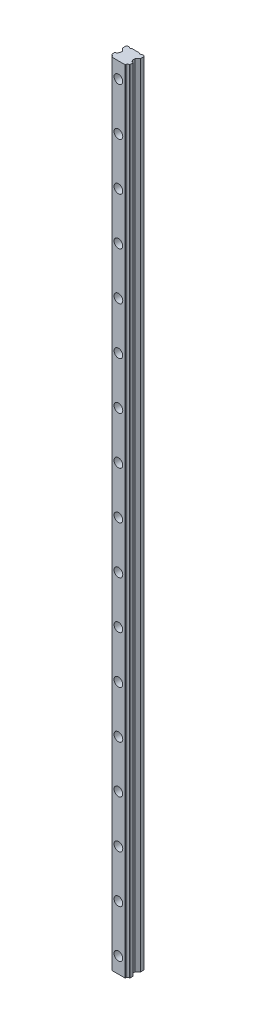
ISO-10303-21;
HEADER;
FILE_DESCRIPTION(('STEP AP214'),'2;1');
FILE_NAME('part.step','',(''),(''),'','','');
FILE_SCHEMA(('AUTOMOTIVE_DESIGN { 1 0 10303 214 1 1 1 1 }'));
ENDSEC;
DATA;
#1=APPLICATION_CONTEXT('core data for automotive mechanical design processes');
#2=APPLICATION_PROTOCOL_DEFINITION('international standard','automotive_design',2000,#1);
#3=PRODUCT_CONTEXT('',#1,'mechanical');
#4=PRODUCT('Part','Part','',(#3));
#5=PRODUCT_RELATED_PRODUCT_CATEGORY('part','',(#4));
#6=PRODUCT_DEFINITION_FORMATION('','',#4);
#7=PRODUCT_DEFINITION_CONTEXT('part definition',#1,'design');
#8=PRODUCT_DEFINITION('design','',#6,#7);
#9=PRODUCT_DEFINITION_SHAPE('','',#8);
#10=(LENGTH_UNIT() NAMED_UNIT(*) SI_UNIT(.MILLI.,.METRE.));
#11=(NAMED_UNIT(*) PLANE_ANGLE_UNIT() SI_UNIT($,.RADIAN.));
#12=(NAMED_UNIT(*) SI_UNIT($,.STERADIAN.) SOLID_ANGLE_UNIT());
#13=UNCERTAINTY_MEASURE_WITH_UNIT(LENGTH_MEASURE(1.E-05),#10,'distance_accuracy_value','');
#14=(GEOMETRIC_REPRESENTATION_CONTEXT(3) GLOBAL_UNCERTAINTY_ASSIGNED_CONTEXT((#13)) GLOBAL_UNIT_ASSIGNED_CONTEXT((#10,
#11,#12)) REPRESENTATION_CONTEXT('',''));
#15=CARTESIAN_POINT('',(0.,0.,0.));
#16=DIRECTION('',(0.,0.,1.));
#17=DIRECTION('',(1.,0.,0.));
#18=AXIS2_PLACEMENT_3D('',#15,#16,#17);
#19=CARTESIAN_POINT('',(0.,980.,-9.));
#20=DIRECTION('',(0.,0.,-1.));
#21=DIRECTION('',(0.,-1.,0.));
#22=AXIS2_PLACEMENT_3D('',#19,#20,#21);
#23=PLANE('',#22);
#24=CARTESIAN_POINT('',(0.,980.,-9.));
#25=DIRECTION('',(0.,0.,-1.));
#26=DIRECTION('',(0.,-1.,0.));
#27=AXIS2_PLACEMENT_3D('',#24,#25,#26);
#28=CIRCLE('',#27,3.5);
#29=CARTESIAN_POINT('',(0.,976.5,-9.));
#30=VERTEX_POINT('',#29);
#31=EDGE_CURVE('E11',#30,#30,#28,.T.);
#32=ORIENTED_EDGE('',*,*,#31,.T.);
#33=EDGE_LOOP('',(#32));
#34=FACE_BOUND('',#33,.T.);
#35=CARTESIAN_POINT('',(0.,980.,-9.));
#36=DIRECTION('',(0.,0.,1.));
#37=DIRECTION('',(0.,-1.,0.));
#38=AXIS2_PLACEMENT_3D('',#35,#36,#37);
#39=CIRCLE('',#38,5.5);
#40=CARTESIAN_POINT('',(0.,974.5,-9.));
#41=VERTEX_POINT('',#40);
#42=EDGE_CURVE('E28',#41,#41,#39,.T.);
#43=ORIENTED_EDGE('',*,*,#42,.T.);
#44=EDGE_LOOP('',(#43));
#45=FACE_BOUND('',#44,.T.);
#46=ADVANCED_FACE('F17',(#34,#45),#23,.F.);
#47=CARTESIAN_POINT('',(0.,980.,0.));
#48=DIRECTION('',(0.,0.,-1.));
#49=DIRECTION('',(0.,-1.,0.));
#50=AXIS2_PLACEMENT_3D('',#47,#48,#49);
#51=CYLINDRICAL_SURFACE('',#50,5.5);
#52=ORIENTED_EDGE('',*,*,#42,.F.);
#53=EDGE_LOOP('',(#52));
#54=FACE_BOUND('',#53,.T.);
#55=CARTESIAN_POINT('',(0.,980.,0.));
#56=DIRECTION('',(0.,0.,-1.));
#57=DIRECTION('',(0.,-1.,0.));
#58=AXIS2_PLACEMENT_3D('',#55,#56,#57);
#59=CIRCLE('',#58,5.5);
#60=CARTESIAN_POINT('',(0.,974.5,0.));
#61=VERTEX_POINT('',#60);
#62=EDGE_CURVE('E478',#61,#61,#59,.T.);
#63=ORIENTED_EDGE('',*,*,#62,.F.);
#64=EDGE_LOOP('',(#63));
#65=FACE_BOUND('',#64,.T.);
#66=ADVANCED_FACE('F479',(#54,#65),#51,.F.);
#67=CARTESIAN_POINT('',(0.,980.,-9.));
#68=DIRECTION('',(0.,0.,-1.));
#69=DIRECTION('',(0.,-1.,0.));
#70=AXIS2_PLACEMENT_3D('',#67,#68,#69);
#71=CYLINDRICAL_SURFACE('',#70,3.5);
#72=CARTESIAN_POINT('',(0.,980.,-22.));
#73=DIRECTION('',(0.,0.,-1.));
#74=DIRECTION('',(-1.,0.,0.));
#75=AXIS2_PLACEMENT_3D('',#72,#73,#74);
#76=CIRCLE('',#75,3.5);
#77=CARTESIAN_POINT('',(-3.5,980.,-22.));
#78=VERTEX_POINT('',#77);
#79=EDGE_CURVE('E522',#78,#78,#76,.T.);
#80=ORIENTED_EDGE('',*,*,#79,.T.);
#81=EDGE_LOOP('',(#80));
#82=FACE_BOUND('',#81,.T.);
#83=ORIENTED_EDGE('',*,*,#31,.F.);
#84=EDGE_LOOP('',(#83));
#85=FACE_BOUND('',#84,.T.);
#86=ADVANCED_FACE('F1267',(#82,#85),#71,.F.);
#87=CARTESIAN_POINT('',(0.,920.,-9.));
#88=DIRECTION('',(0.,0.,-1.));
#89=DIRECTION('',(0.,-1.,0.));
#90=AXIS2_PLACEMENT_3D('',#87,#88,#89);
#91=PLANE('',#90);
#92=CARTESIAN_POINT('',(0.,920.,-9.));
#93=DIRECTION('',(0.,0.,-1.));
#94=DIRECTION('',(0.,-1.,0.));
#95=AXIS2_PLACEMENT_3D('',#92,#93,#94);
#96=CIRCLE('',#95,3.5);
#97=CARTESIAN_POINT('',(0.,916.5,-9.));
#98=VERTEX_POINT('',#97);
#99=EDGE_CURVE('E518',#98,#98,#96,.T.);
#100=ORIENTED_EDGE('',*,*,#99,.T.);
#101=EDGE_LOOP('',(#100));
#102=FACE_BOUND('',#101,.T.);
#103=CARTESIAN_POINT('',(0.,920.,-9.));
#104=DIRECTION('',(0.,0.,1.));
#105=DIRECTION('',(0.,-1.,0.));
#106=AXIS2_PLACEMENT_3D('',#103,#104,#105);
#107=CIRCLE('',#106,5.5);
#108=CARTESIAN_POINT('',(0.,914.5,-9.));
#109=VERTEX_POINT('',#108);
#110=EDGE_CURVE('E523',#109,#109,#107,.T.);
#111=ORIENTED_EDGE('',*,*,#110,.T.);
#112=EDGE_LOOP('',(#111));
#113=FACE_BOUND('',#112,.T.);
#114=ADVANCED_FACE('F1285',(#102,#113),#91,.F.);
#115=CARTESIAN_POINT('',(0.,920.,0.));
#116=DIRECTION('',(0.,0.,-1.));
#117=DIRECTION('',(0.,-1.,0.));
#118=AXIS2_PLACEMENT_3D('',#115,#116,#117);
#119=CYLINDRICAL_SURFACE('',#118,5.5);
#120=ORIENTED_EDGE('',*,*,#110,.F.);
#121=EDGE_LOOP('',(#120));
#122=FACE_BOUND('',#121,.T.);
#123=CARTESIAN_POINT('',(0.,920.,0.));
#124=DIRECTION('',(0.,0.,-1.));
#125=DIRECTION('',(0.,-1.,0.));
#126=AXIS2_PLACEMENT_3D('',#123,#124,#125);
#127=CIRCLE('',#126,5.5);
#128=CARTESIAN_POINT('',(0.,914.5,0.));
#129=VERTEX_POINT('',#128);
#130=EDGE_CURVE('E483',#129,#129,#127,.T.);
#131=ORIENTED_EDGE('',*,*,#130,.F.);
#132=EDGE_LOOP('',(#131));
#133=FACE_BOUND('',#132,.T.);
#134=ADVANCED_FACE('F1360',(#122,#133),#119,.F.);
#135=CARTESIAN_POINT('',(0.,920.,-9.));
#136=DIRECTION('',(0.,0.,-1.));
#137=DIRECTION('',(0.,-1.,0.));
#138=AXIS2_PLACEMENT_3D('',#135,#136,#137);
#139=CYLINDRICAL_SURFACE('',#138,3.5);
#140=CARTESIAN_POINT('',(0.,920.,-22.));
#141=DIRECTION('',(0.,0.,-1.));
#142=DIRECTION('',(-1.,0.,0.));
#143=AXIS2_PLACEMENT_3D('',#140,#141,#142);
#144=CIRCLE('',#143,3.5);
#145=CARTESIAN_POINT('',(-3.5,920.,-22.));
#146=VERTEX_POINT('',#145);
#147=EDGE_CURVE('E549',#146,#146,#144,.T.);
#148=ORIENTED_EDGE('',*,*,#147,.T.);
#149=EDGE_LOOP('',(#148));
#150=FACE_BOUND('',#149,.T.);
#151=ORIENTED_EDGE('',*,*,#99,.F.);
#152=EDGE_LOOP('',(#151));
#153=FACE_BOUND('',#152,.T.);
#154=ADVANCED_FACE('F1364',(#150,#153),#139,.F.);
#155=CARTESIAN_POINT('',(0.,860.,-9.));
#156=DIRECTION('',(0.,0.,-1.));
#157=DIRECTION('',(0.,-1.,0.));
#158=AXIS2_PLACEMENT_3D('',#155,#156,#157);
#159=PLANE('',#158);
#160=CARTESIAN_POINT('',(0.,860.,-9.));
#161=DIRECTION('',(0.,0.,-1.));
#162=DIRECTION('',(0.,-1.,0.));
#163=AXIS2_PLACEMENT_3D('',#160,#161,#162);
#164=CIRCLE('',#163,3.5);
#165=CARTESIAN_POINT('',(0.,856.5,-9.));
#166=VERTEX_POINT('',#165);
#167=EDGE_CURVE('E755',#166,#166,#164,.T.);
#168=ORIENTED_EDGE('',*,*,#167,.T.);
#169=EDGE_LOOP('',(#168));
#170=FACE_BOUND('',#169,.T.);
#171=CARTESIAN_POINT('',(0.,860.,-9.));
#172=DIRECTION('',(0.,0.,1.));
#173=DIRECTION('',(0.,-1.,0.));
#174=AXIS2_PLACEMENT_3D('',#171,#172,#173);
#175=CIRCLE('',#174,5.5);
#176=CARTESIAN_POINT('',(0.,854.5,-9.));
#177=VERTEX_POINT('',#176);
#178=EDGE_CURVE('E759',#177,#177,#175,.T.);
#179=ORIENTED_EDGE('',*,*,#178,.T.);
#180=EDGE_LOOP('',(#179));
#181=FACE_BOUND('',#180,.T.);
#182=ADVANCED_FACE('F1366',(#170,#181),#159,.F.);
#183=CARTESIAN_POINT('',(0.,860.,0.));
#184=DIRECTION('',(0.,0.,-1.));
#185=DIRECTION('',(0.,-1.,0.));
#186=AXIS2_PLACEMENT_3D('',#183,#184,#185);
#187=CYLINDRICAL_SURFACE('',#186,5.5);
#188=ORIENTED_EDGE('',*,*,#178,.F.);
#189=EDGE_LOOP('',(#188));
#190=FACE_BOUND('',#189,.T.);
#191=CARTESIAN_POINT('',(0.,860.,0.));
#192=DIRECTION('',(0.,0.,-1.));
#193=DIRECTION('',(0.,-1.,0.));
#194=AXIS2_PLACEMENT_3D('',#191,#192,#193);
#195=CIRCLE('',#194,5.5);
#196=CARTESIAN_POINT('',(0.,854.5,0.));
#197=VERTEX_POINT('',#196);
#198=EDGE_CURVE('E494',#197,#197,#195,.T.);
#199=ORIENTED_EDGE('',*,*,#198,.F.);
#200=EDGE_LOOP('',(#199));
#201=FACE_BOUND('',#200,.T.);
#202=ADVANCED_FACE('F1369',(#190,#201),#187,.F.);
#203=CARTESIAN_POINT('',(0.,860.,-9.));
#204=DIRECTION('',(0.,0.,-1.));
#205=DIRECTION('',(0.,-1.,0.));
#206=AXIS2_PLACEMENT_3D('',#203,#204,#205);
#207=CYLINDRICAL_SURFACE('',#206,3.5);
#208=CARTESIAN_POINT('',(0.,860.,-22.));
#209=DIRECTION('',(0.,0.,-1.));
#210=DIRECTION('',(-1.,0.,0.));
#211=AXIS2_PLACEMENT_3D('',#208,#209,#210);
#212=CIRCLE('',#211,3.5);
#213=CARTESIAN_POINT('',(-3.5,860.,-22.));
#214=VERTEX_POINT('',#213);
#215=EDGE_CURVE('E572',#214,#214,#212,.T.);
#216=ORIENTED_EDGE('',*,*,#215,.T.);
#217=EDGE_LOOP('',(#216));
#218=FACE_BOUND('',#217,.T.);
#219=ORIENTED_EDGE('',*,*,#167,.F.);
#220=EDGE_LOOP('',(#219));
#221=FACE_BOUND('',#220,.T.);
#222=ADVANCED_FACE('F1529',(#218,#221),#207,.F.);
#223=CARTESIAN_POINT('',(0.,800.,-9.));
#224=DIRECTION('',(0.,0.,-1.));
#225=DIRECTION('',(0.,-1.,0.));
#226=AXIS2_PLACEMENT_3D('',#223,#224,#225);
#227=PLANE('',#226);
#228=CARTESIAN_POINT('',(0.,800.,-9.));
#229=DIRECTION('',(0.,0.,-1.));
#230=DIRECTION('',(0.,-1.,0.));
#231=AXIS2_PLACEMENT_3D('',#228,#229,#230);
#232=CIRCLE('',#231,3.5);
#233=CARTESIAN_POINT('',(0.,796.5,-9.));
#234=VERTEX_POINT('',#233);
#235=EDGE_CURVE('E568',#234,#234,#232,.T.);
#236=ORIENTED_EDGE('',*,*,#235,.T.);
#237=EDGE_LOOP('',(#236));
#238=FACE_BOUND('',#237,.T.);
#239=CARTESIAN_POINT('',(0.,800.,-9.));
#240=DIRECTION('',(0.,0.,1.));
#241=DIRECTION('',(0.,-1.,0.));
#242=AXIS2_PLACEMENT_3D('',#239,#240,#241);
#243=CIRCLE('',#242,5.5);
#244=CARTESIAN_POINT('',(0.,794.5,-9.));
#245=VERTEX_POINT('',#244);
#246=EDGE_CURVE('E573',#245,#245,#243,.T.);
#247=ORIENTED_EDGE('',*,*,#246,.T.);
#248=EDGE_LOOP('',(#247));
#249=FACE_BOUND('',#248,.T.);
#250=ADVANCED_FACE('F1532',(#238,#249),#227,.F.);
#251=CARTESIAN_POINT('',(0.,800.,0.));
#252=DIRECTION('',(0.,0.,-1.));
#253=DIRECTION('',(0.,-1.,0.));
#254=AXIS2_PLACEMENT_3D('',#251,#252,#253);
#255=CYLINDRICAL_SURFACE('',#254,5.5);
#256=ORIENTED_EDGE('',*,*,#246,.F.);
#257=EDGE_LOOP('',(#256));
#258=FACE_BOUND('',#257,.T.);
#259=CARTESIAN_POINT('',(0.,800.,0.));
#260=DIRECTION('',(0.,0.,-1.));
#261=DIRECTION('',(0.,-1.,0.));
#262=AXIS2_PLACEMENT_3D('',#259,#260,#261);
#263=CIRCLE('',#262,5.5);
#264=CARTESIAN_POINT('',(0.,794.5,0.));
#265=VERTEX_POINT('',#264);
#266=EDGE_CURVE('E887',#265,#265,#263,.T.);
#267=ORIENTED_EDGE('',*,*,#266,.F.);
#268=EDGE_LOOP('',(#267));
#269=FACE_BOUND('',#268,.T.);
#270=ADVANCED_FACE('F1333',(#258,#269),#255,.F.);
#271=CARTESIAN_POINT('',(0.,800.,-9.));
#272=DIRECTION('',(0.,0.,-1.));
#273=DIRECTION('',(0.,-1.,0.));
#274=AXIS2_PLACEMENT_3D('',#271,#272,#273);
#275=CYLINDRICAL_SURFACE('',#274,3.5);
#276=CARTESIAN_POINT('',(0.,800.,-22.));
#277=DIRECTION('',(0.,0.,-1.));
#278=DIRECTION('',(-1.,0.,0.));
#279=AXIS2_PLACEMENT_3D('',#276,#277,#278);
#280=CIRCLE('',#279,3.5);
#281=CARTESIAN_POINT('',(-3.5,800.,-22.));
#282=VERTEX_POINT('',#281);
#283=EDGE_CURVE('E714',#282,#282,#280,.T.);
#284=ORIENTED_EDGE('',*,*,#283,.T.);
#285=EDGE_LOOP('',(#284));
#286=FACE_BOUND('',#285,.T.);
#287=ORIENTED_EDGE('',*,*,#235,.F.);
#288=EDGE_LOOP('',(#287));
#289=FACE_BOUND('',#288,.T.);
#290=ADVANCED_FACE('F1329',(#286,#289),#275,.F.);
#291=CARTESIAN_POINT('',(0.,740.,-9.));
#292=DIRECTION('',(0.,0.,-1.));
#293=DIRECTION('',(0.,-1.,0.));
#294=AXIS2_PLACEMENT_3D('',#291,#292,#293);
#295=PLANE('',#294);
#296=CARTESIAN_POINT('',(0.,740.,-9.));
#297=DIRECTION('',(0.,0.,-1.));
#298=DIRECTION('',(0.,-1.,0.));
#299=AXIS2_PLACEMENT_3D('',#296,#297,#298);
#300=CIRCLE('',#299,3.5);
#301=CARTESIAN_POINT('',(0.,736.5,-9.));
#302=VERTEX_POINT('',#301);
#303=EDGE_CURVE('E718',#302,#302,#300,.T.);
#304=ORIENTED_EDGE('',*,*,#303,.T.);
#305=EDGE_LOOP('',(#304));
#306=FACE_BOUND('',#305,.T.);
#307=CARTESIAN_POINT('',(0.,740.,-9.));
#308=DIRECTION('',(0.,0.,1.));
#309=DIRECTION('',(0.,-1.,0.));
#310=AXIS2_PLACEMENT_3D('',#307,#308,#309);
#311=CIRCLE('',#310,5.5);
#312=CARTESIAN_POINT('',(0.,734.5,-9.));
#313=VERTEX_POINT('',#312);
#314=EDGE_CURVE('E1004',#313,#313,#311,.T.);
#315=ORIENTED_EDGE('',*,*,#314,.T.);
#316=EDGE_LOOP('',(#315));
#317=FACE_BOUND('',#316,.T.);
#318=ADVANCED_FACE('F1332',(#306,#317),#295,.F.);
#319=CARTESIAN_POINT('',(0.,740.,0.));
#320=DIRECTION('',(0.,0.,-1.));
#321=DIRECTION('',(0.,-1.,0.));
#322=AXIS2_PLACEMENT_3D('',#319,#320,#321);
#323=CYLINDRICAL_SURFACE('',#322,5.5);
#324=ORIENTED_EDGE('',*,*,#314,.F.);
#325=EDGE_LOOP('',(#324));
#326=FACE_BOUND('',#325,.T.);
#327=CARTESIAN_POINT('',(0.,740.,0.));
#328=DIRECTION('',(0.,0.,-1.));
#329=DIRECTION('',(0.,-1.,0.));
#330=AXIS2_PLACEMENT_3D('',#327,#328,#329);
#331=CIRCLE('',#330,5.5);
#332=CARTESIAN_POINT('',(0.,734.5,0.));
#333=VERTEX_POINT('',#332);
#334=EDGE_CURVE('E883',#333,#333,#331,.T.);
#335=ORIENTED_EDGE('',*,*,#334,.F.);
#336=EDGE_LOOP('',(#335));
#337=FACE_BOUND('',#336,.T.);
#338=ADVANCED_FACE('F1347',(#326,#337),#323,.F.);
#339=CARTESIAN_POINT('',(0.,740.,-9.));
#340=DIRECTION('',(0.,0.,-1.));
#341=DIRECTION('',(0.,-1.,0.));
#342=AXIS2_PLACEMENT_3D('',#339,#340,#341);
#343=CYLINDRICAL_SURFACE('',#342,3.5);
#344=CARTESIAN_POINT('',(0.,740.,-22.));
#345=DIRECTION('',(0.,0.,-1.));
#346=DIRECTION('',(-1.,0.,0.));
#347=AXIS2_PLACEMENT_3D('',#344,#345,#346);
#348=CIRCLE('',#347,3.5);
#349=CARTESIAN_POINT('',(-3.5,740.,-22.));
#350=VERTEX_POINT('',#349);
#351=EDGE_CURVE('E928',#350,#350,#348,.T.);
#352=ORIENTED_EDGE('',*,*,#351,.T.);
#353=EDGE_LOOP('',(#352));
#354=FACE_BOUND('',#353,.T.);
#355=ORIENTED_EDGE('',*,*,#303,.F.);
#356=EDGE_LOOP('',(#355));
#357=FACE_BOUND('',#356,.T.);
#358=ADVANCED_FACE('F1349',(#354,#357),#343,.F.);
#359=CARTESIAN_POINT('',(0.,680.,-9.));
#360=DIRECTION('',(0.,0.,-1.));
#361=DIRECTION('',(0.,-1.,0.));
#362=AXIS2_PLACEMENT_3D('',#359,#360,#361);
#363=PLANE('',#362);
#364=CARTESIAN_POINT('',(0.,680.,-9.));
#365=DIRECTION('',(0.,0.,-1.));
#366=DIRECTION('',(0.,-1.,0.));
#367=AXIS2_PLACEMENT_3D('',#364,#365,#366);
#368=CIRCLE('',#367,3.5);
#369=CARTESIAN_POINT('',(0.,676.5,-9.));
#370=VERTEX_POINT('',#369);
#371=EDGE_CURVE('E907',#370,#370,#368,.T.);
#372=ORIENTED_EDGE('',*,*,#371,.T.);
#373=EDGE_LOOP('',(#372));
#374=FACE_BOUND('',#373,.T.);
#375=CARTESIAN_POINT('',(0.,680.,-9.));
#376=DIRECTION('',(0.,0.,1.));
#377=DIRECTION('',(0.,-1.,0.));
#378=AXIS2_PLACEMENT_3D('',#375,#376,#377);
#379=CIRCLE('',#378,5.5);
#380=CARTESIAN_POINT('',(0.,674.5,-9.));
#381=VERTEX_POINT('',#380);
#382=EDGE_CURVE('E510',#381,#381,#379,.T.);
#383=ORIENTED_EDGE('',*,*,#382,.T.);
#384=EDGE_LOOP('',(#383));
#385=FACE_BOUND('',#384,.T.);
#386=ADVANCED_FACE('F1461',(#374,#385),#363,.F.);
#387=CARTESIAN_POINT('',(0.,680.,0.));
#388=DIRECTION('',(0.,0.,-1.));
#389=DIRECTION('',(0.,-1.,0.));
#390=AXIS2_PLACEMENT_3D('',#387,#388,#389);
#391=CYLINDRICAL_SURFACE('',#390,5.5);
#392=ORIENTED_EDGE('',*,*,#382,.F.);
#393=EDGE_LOOP('',(#392));
#394=FACE_BOUND('',#393,.T.);
#395=CARTESIAN_POINT('',(0.,680.,0.));
#396=DIRECTION('',(0.,0.,-1.));
#397=DIRECTION('',(0.,-1.,0.));
#398=AXIS2_PLACEMENT_3D('',#395,#396,#397);
#399=CIRCLE('',#398,5.5);
#400=CARTESIAN_POINT('',(0.,674.5,0.));
#401=VERTEX_POINT('',#400);
#402=EDGE_CURVE('E888',#401,#401,#399,.T.);
#403=ORIENTED_EDGE('',*,*,#402,.F.);
#404=EDGE_LOOP('',(#403));
#405=FACE_BOUND('',#404,.T.);
#406=ADVANCED_FACE('F1524',(#394,#405),#391,.F.);
#407=CARTESIAN_POINT('',(0.,680.,-9.));
#408=DIRECTION('',(0.,0.,-1.));
#409=DIRECTION('',(0.,-1.,0.));
#410=AXIS2_PLACEMENT_3D('',#407,#408,#409);
#411=CYLINDRICAL_SURFACE('',#410,3.5);
#412=CARTESIAN_POINT('',(0.,680.,-22.));
#413=DIRECTION('',(0.,0.,-1.));
#414=DIRECTION('',(-1.,0.,0.));
#415=AXIS2_PLACEMENT_3D('',#412,#413,#414);
#416=CIRCLE('',#415,3.5);
#417=CARTESIAN_POINT('',(-3.5,680.,-22.));
#418=VERTEX_POINT('',#417);
#419=EDGE_CURVE('E506',#418,#418,#416,.T.);
#420=ORIENTED_EDGE('',*,*,#419,.T.);
#421=EDGE_LOOP('',(#420));
#422=FACE_BOUND('',#421,.T.);
#423=ORIENTED_EDGE('',*,*,#371,.F.);
#424=EDGE_LOOP('',(#423));
#425=FACE_BOUND('',#424,.T.);
#426=ADVANCED_FACE('F1534',(#422,#425),#411,.F.);
#427=CARTESIAN_POINT('',(0.,620.,-9.));
#428=DIRECTION('',(0.,0.,-1.));
#429=DIRECTION('',(0.,-1.,0.));
#430=AXIS2_PLACEMENT_3D('',#427,#428,#429);
#431=PLANE('',#430);
#432=CARTESIAN_POINT('',(0.,620.,-9.));
#433=DIRECTION('',(0.,0.,-1.));
#434=DIRECTION('',(0.,-1.,0.));
#435=AXIS2_PLACEMENT_3D('',#432,#433,#434);
#436=CIRCLE('',#435,3.5);
#437=CARTESIAN_POINT('',(0.,616.5,-9.));
#438=VERTEX_POINT('',#437);
#439=EDGE_CURVE('E511',#438,#438,#436,.T.);
#440=ORIENTED_EDGE('',*,*,#439,.T.);
#441=EDGE_LOOP('',(#440));
#442=FACE_BOUND('',#441,.T.);
#443=CARTESIAN_POINT('',(0.,620.,-9.));
#444=DIRECTION('',(0.,0.,1.));
#445=DIRECTION('',(0.,-1.,0.));
#446=AXIS2_PLACEMENT_3D('',#443,#444,#445);
#447=CIRCLE('',#446,5.5);
#448=CARTESIAN_POINT('',(0.,614.5,-9.));
#449=VERTEX_POINT('',#448);
#450=EDGE_CURVE('E833',#449,#449,#447,.T.);
#451=ORIENTED_EDGE('',*,*,#450,.T.);
#452=EDGE_LOOP('',(#451));
#453=FACE_BOUND('',#452,.T.);
#454=ADVANCED_FACE('F1319',(#442,#453),#431,.F.);
#455=CARTESIAN_POINT('',(0.,620.,0.));
#456=DIRECTION('',(0.,0.,-1.));
#457=DIRECTION('',(0.,-1.,0.));
#458=AXIS2_PLACEMENT_3D('',#455,#456,#457);
#459=CYLINDRICAL_SURFACE('',#458,5.5);
#460=ORIENTED_EDGE('',*,*,#450,.F.);
#461=EDGE_LOOP('',(#460));
#462=FACE_BOUND('',#461,.T.);
#463=CARTESIAN_POINT('',(0.,620.,0.));
#464=DIRECTION('',(0.,0.,-1.));
#465=DIRECTION('',(0.,-1.,0.));
#466=AXIS2_PLACEMENT_3D('',#463,#464,#465);
#467=CIRCLE('',#466,5.5);
#468=CARTESIAN_POINT('',(0.,614.5,0.));
#469=VERTEX_POINT('',#468);
#470=EDGE_CURVE('E612',#469,#469,#467,.T.);
#471=ORIENTED_EDGE('',*,*,#470,.F.);
#472=EDGE_LOOP('',(#471));
#473=FACE_BOUND('',#472,.T.);
#474=ADVANCED_FACE('F1315',(#462,#473),#459,.F.);
#475=CARTESIAN_POINT('',(0.,620.,-9.));
#476=DIRECTION('',(0.,0.,-1.));
#477=DIRECTION('',(0.,-1.,0.));
#478=AXIS2_PLACEMENT_3D('',#475,#476,#477);
#479=CYLINDRICAL_SURFACE('',#478,3.5);
#480=CARTESIAN_POINT('',(0.,620.,-22.));
#481=DIRECTION('',(0.,0.,-1.));
#482=DIRECTION('',(-1.,0.,0.));
#483=AXIS2_PLACEMENT_3D('',#480,#481,#482);
#484=CIRCLE('',#483,3.5);
#485=CARTESIAN_POINT('',(-3.5,620.,-22.));
#486=VERTEX_POINT('',#485);
#487=EDGE_CURVE('E824',#486,#486,#484,.T.);
#488=ORIENTED_EDGE('',*,*,#487,.T.);
#489=EDGE_LOOP('',(#488));
#490=FACE_BOUND('',#489,.T.);
#491=ORIENTED_EDGE('',*,*,#439,.F.);
#492=EDGE_LOOP('',(#491));
#493=FACE_BOUND('',#492,.T.);
#494=ADVANCED_FACE('F1318',(#490,#493),#479,.F.);
#495=CARTESIAN_POINT('',(0.,560.,-9.));
#496=DIRECTION('',(0.,0.,-1.));
#497=DIRECTION('',(0.,-1.,0.));
#498=AXIS2_PLACEMENT_3D('',#495,#496,#497);
#499=PLANE('',#498);
#500=CARTESIAN_POINT('',(0.,560.,-9.));
#501=DIRECTION('',(0.,0.,-1.));
#502=DIRECTION('',(0.,-1.,0.));
#503=AXIS2_PLACEMENT_3D('',#500,#501,#502);
#504=CIRCLE('',#503,3.5);
#505=CARTESIAN_POINT('',(0.,556.5,-9.));
#506=VERTEX_POINT('',#505);
#507=EDGE_CURVE('E820',#506,#506,#504,.T.);
#508=ORIENTED_EDGE('',*,*,#507,.T.);
#509=EDGE_LOOP('',(#508));
#510=FACE_BOUND('',#509,.T.);
#511=CARTESIAN_POINT('',(0.,560.,-9.));
#512=DIRECTION('',(0.,0.,1.));
#513=DIRECTION('',(0.,-1.,0.));
#514=AXIS2_PLACEMENT_3D('',#511,#512,#513);
#515=CIRCLE('',#514,5.5);
#516=CARTESIAN_POINT('',(0.,554.5,-9.));
#517=VERTEX_POINT('',#516);
#518=EDGE_CURVE('E825',#517,#517,#515,.T.);
#519=ORIENTED_EDGE('',*,*,#518,.T.);
#520=EDGE_LOOP('',(#519));
#521=FACE_BOUND('',#520,.T.);
#522=ADVANCED_FACE('F1389',(#510,#521),#499,.F.);
#523=CARTESIAN_POINT('',(0.,560.,0.));
#524=DIRECTION('',(0.,0.,-1.));
#525=DIRECTION('',(0.,-1.,0.));
#526=AXIS2_PLACEMENT_3D('',#523,#524,#525);
#527=CYLINDRICAL_SURFACE('',#526,5.5);
#528=ORIENTED_EDGE('',*,*,#518,.F.);
#529=EDGE_LOOP('',(#528));
#530=FACE_BOUND('',#529,.T.);
#531=CARTESIAN_POINT('',(0.,560.,0.));
#532=DIRECTION('',(0.,0.,-1.));
#533=DIRECTION('',(0.,-1.,0.));
#534=AXIS2_PLACEMENT_3D('',#531,#532,#533);
#535=CIRCLE('',#534,5.5);
#536=CARTESIAN_POINT('',(0.,554.5,0.));
#537=VERTEX_POINT('',#536);
#538=EDGE_CURVE('E608',#537,#537,#535,.T.);
#539=ORIENTED_EDGE('',*,*,#538,.F.);
#540=EDGE_LOOP('',(#539));
#541=FACE_BOUND('',#540,.T.);
#542=ADVANCED_FACE('F1383',(#530,#541),#527,.F.);
#543=CARTESIAN_POINT('',(0.,560.,-9.));
#544=DIRECTION('',(0.,0.,-1.));
#545=DIRECTION('',(0.,-1.,0.));
#546=AXIS2_PLACEMENT_3D('',#543,#544,#545);
#547=CYLINDRICAL_SURFACE('',#546,3.5);
#548=CARTESIAN_POINT('',(0.,560.,-22.));
#549=DIRECTION('',(0.,0.,-1.));
#550=DIRECTION('',(-1.,0.,0.));
#551=AXIS2_PLACEMENT_3D('',#548,#549,#550);
#552=CIRCLE('',#551,3.5);
#553=CARTESIAN_POINT('',(-3.5,560.,-22.));
#554=VERTEX_POINT('',#553);
#555=EDGE_CURVE('E876',#554,#554,#552,.T.);
#556=ORIENTED_EDGE('',*,*,#555,.T.);
#557=EDGE_LOOP('',(#556));
#558=FACE_BOUND('',#557,.T.);
#559=ORIENTED_EDGE('',*,*,#507,.F.);
#560=EDGE_LOOP('',(#559));
#561=FACE_BOUND('',#560,.T.);
#562=ADVANCED_FACE('F1244',(#558,#561),#547,.F.);
#563=CARTESIAN_POINT('',(0.,500.,-9.));
#564=DIRECTION('',(0.,0.,-1.));
#565=DIRECTION('',(0.,-1.,0.));
#566=AXIS2_PLACEMENT_3D('',#563,#564,#565);
#567=PLANE('',#566);
#568=CARTESIAN_POINT('',(0.,500.,-9.));
#569=DIRECTION('',(0.,0.,-1.));
#570=DIRECTION('',(0.,-1.,0.));
#571=AXIS2_PLACEMENT_3D('',#568,#569,#570);
#572=CIRCLE('',#571,3.5);
#573=CARTESIAN_POINT('',(0.,496.5,-9.));
#574=VERTEX_POINT('',#573);
#575=EDGE_CURVE('E554',#574,#574,#572,.T.);
#576=ORIENTED_EDGE('',*,*,#575,.T.);
#577=EDGE_LOOP('',(#576));
#578=FACE_BOUND('',#577,.T.);
#579=CARTESIAN_POINT('',(0.,500.,-9.));
#580=DIRECTION('',(0.,0.,1.));
#581=DIRECTION('',(0.,-1.,0.));
#582=AXIS2_PLACEMENT_3D('',#579,#580,#581);
#583=CIRCLE('',#582,5.5);
#584=CARTESIAN_POINT('',(0.,494.5,-9.));
#585=VERTEX_POINT('',#584);
#586=EDGE_CURVE('E550',#585,#585,#583,.T.);
#587=ORIENTED_EDGE('',*,*,#586,.T.);
#588=EDGE_LOOP('',(#587));
#589=FACE_BOUND('',#588,.T.);
#590=ADVANCED_FACE('F1240',(#578,#589),#567,.F.);
#591=CARTESIAN_POINT('',(0.,500.,0.));
#592=DIRECTION('',(0.,0.,-1.));
#593=DIRECTION('',(0.,-1.,0.));
#594=AXIS2_PLACEMENT_3D('',#591,#592,#593);
#595=CYLINDRICAL_SURFACE('',#594,5.5);
#596=ORIENTED_EDGE('',*,*,#586,.F.);
#597=EDGE_LOOP('',(#596));
#598=FACE_BOUND('',#597,.T.);
#599=CARTESIAN_POINT('',(0.,500.,0.));
#600=DIRECTION('',(0.,0.,-1.));
#601=DIRECTION('',(0.,-1.,0.));
#602=AXIS2_PLACEMENT_3D('',#599,#600,#601);
#603=CIRCLE('',#602,5.5);
#604=CARTESIAN_POINT('',(0.,494.5,0.));
#605=VERTEX_POINT('',#604);
#606=EDGE_CURVE('E613',#605,#605,#603,.T.);
#607=ORIENTED_EDGE('',*,*,#606,.F.);
#608=EDGE_LOOP('',(#607));
#609=FACE_BOUND('',#608,.T.);
#610=ADVANCED_FACE('F1243',(#598,#609),#595,.F.);
#611=CARTESIAN_POINT('',(0.,500.,-9.));
#612=DIRECTION('',(0.,0.,-1.));
#613=DIRECTION('',(0.,-1.,0.));
#614=AXIS2_PLACEMENT_3D('',#611,#612,#613);
#615=CYLINDRICAL_SURFACE('',#614,3.5);
#616=CARTESIAN_POINT('',(0.,500.,-22.));
#617=DIRECTION('',(0.,0.,-1.));
#618=DIRECTION('',(-1.,0.,0.));
#619=AXIS2_PLACEMENT_3D('',#616,#617,#618);
#620=CIRCLE('',#619,3.5);
#621=CARTESIAN_POINT('',(-3.5,500.,-22.));
#622=VERTEX_POINT('',#621);
#623=EDGE_CURVE('E555',#622,#622,#620,.T.);
#624=ORIENTED_EDGE('',*,*,#623,.T.);
#625=EDGE_LOOP('',(#624));
#626=FACE_BOUND('',#625,.T.);
#627=ORIENTED_EDGE('',*,*,#575,.F.);
#628=EDGE_LOOP('',(#627));
#629=FACE_BOUND('',#628,.T.);
#630=ADVANCED_FACE('F1238',(#626,#629),#615,.F.);
#631=CARTESIAN_POINT('',(0.,440.,-9.));
#632=DIRECTION('',(0.,0.,-1.));
#633=DIRECTION('',(0.,-1.,0.));
#634=AXIS2_PLACEMENT_3D('',#631,#632,#633);
#635=PLANE('',#634);
#636=CARTESIAN_POINT('',(0.,440.,-9.));
#637=DIRECTION('',(0.,0.,-1.));
#638=DIRECTION('',(0.,-1.,0.));
#639=AXIS2_PLACEMENT_3D('',#636,#637,#638);
#640=CIRCLE('',#639,3.5);
#641=CARTESIAN_POINT('',(0.,436.5,-9.));
#642=VERTEX_POINT('',#641);
#643=EDGE_CURVE('E646',#642,#642,#640,.T.);
#644=ORIENTED_EDGE('',*,*,#643,.T.);
#645=EDGE_LOOP('',(#644));
#646=FACE_BOUND('',#645,.T.);
#647=CARTESIAN_POINT('',(0.,440.,-9.));
#648=DIRECTION('',(0.,0.,1.));
#649=DIRECTION('',(0.,-1.,0.));
#650=AXIS2_PLACEMENT_3D('',#647,#648,#649);
#651=CIRCLE('',#650,5.5);
#652=CARTESIAN_POINT('',(0.,434.5,-9.));
#653=VERTEX_POINT('',#652);
#654=EDGE_CURVE('E632',#653,#653,#651,.T.);
#655=ORIENTED_EDGE('',*,*,#654,.T.);
#656=EDGE_LOOP('',(#655));
#657=FACE_BOUND('',#656,.T.);
#658=ADVANCED_FACE('F1122',(#646,#657),#635,.F.);
#659=CARTESIAN_POINT('',(0.,440.,0.));
#660=DIRECTION('',(0.,0.,-1.));
#661=DIRECTION('',(0.,-1.,0.));
#662=AXIS2_PLACEMENT_3D('',#659,#660,#661);
#663=CYLINDRICAL_SURFACE('',#662,5.5);
#664=ORIENTED_EDGE('',*,*,#654,.F.);
#665=EDGE_LOOP('',(#664));
#666=FACE_BOUND('',#665,.T.);
#667=CARTESIAN_POINT('',(0.,440.,0.));
#668=DIRECTION('',(0.,0.,-1.));
#669=DIRECTION('',(0.,-1.,0.));
#670=AXIS2_PLACEMENT_3D('',#667,#668,#669);
#671=CIRCLE('',#670,5.5);
#672=CARTESIAN_POINT('',(0.,434.5,0.));
#673=VERTEX_POINT('',#672);
#674=EDGE_CURVE('E653',#673,#673,#671,.T.);
#675=ORIENTED_EDGE('',*,*,#674,.F.);
#676=EDGE_LOOP('',(#675));
#677=FACE_BOUND('',#676,.T.);
#678=ADVANCED_FACE('F1124',(#666,#677),#663,.F.);
#679=CARTESIAN_POINT('',(0.,440.,-9.));
#680=DIRECTION('',(0.,0.,-1.));
#681=DIRECTION('',(0.,-1.,0.));
#682=AXIS2_PLACEMENT_3D('',#679,#680,#681);
#683=CYLINDRICAL_SURFACE('',#682,3.5);
#684=CARTESIAN_POINT('',(0.,440.,-22.));
#685=DIRECTION('',(0.,0.,-1.));
#686=DIRECTION('',(-1.,0.,0.));
#687=AXIS2_PLACEMENT_3D('',#684,#685,#686);
#688=CIRCLE('',#687,3.5);
#689=CARTESIAN_POINT('',(-3.5,440.,-22.));
#690=VERTEX_POINT('',#689);
#691=EDGE_CURVE('E584',#690,#690,#688,.T.);
#692=ORIENTED_EDGE('',*,*,#691,.T.);
#693=EDGE_LOOP('',(#692));
#694=FACE_BOUND('',#693,.T.);
#695=ORIENTED_EDGE('',*,*,#643,.F.);
#696=EDGE_LOOP('',(#695));
#697=FACE_BOUND('',#696,.T.);
#698=ADVANCED_FACE('F1127',(#694,#697),#683,.F.);
#699=CARTESIAN_POINT('',(0.,380.,-9.));
#700=DIRECTION('',(0.,0.,-1.));
#701=DIRECTION('',(0.,-1.,0.));
#702=AXIS2_PLACEMENT_3D('',#699,#700,#701);
#703=PLANE('',#702);
#704=CARTESIAN_POINT('',(0.,380.,-9.));
#705=DIRECTION('',(0.,0.,-1.));
#706=DIRECTION('',(0.,-1.,0.));
#707=AXIS2_PLACEMENT_3D('',#704,#705,#706);
#708=CIRCLE('',#707,3.5);
#709=CARTESIAN_POINT('',(0.,376.5,-9.));
#710=VERTEX_POINT('',#709);
#711=EDGE_CURVE('E580',#710,#710,#708,.T.);
#712=ORIENTED_EDGE('',*,*,#711,.T.);
#713=EDGE_LOOP('',(#712));
#714=FACE_BOUND('',#713,.T.);
#715=CARTESIAN_POINT('',(0.,380.,-9.));
#716=DIRECTION('',(0.,0.,1.));
#717=DIRECTION('',(0.,-1.,0.));
#718=AXIS2_PLACEMENT_3D('',#715,#716,#717);
#719=CIRCLE('',#718,5.5);
#720=CARTESIAN_POINT('',(0.,374.5,-9.));
#721=VERTEX_POINT('',#720);
#722=EDGE_CURVE('E585',#721,#721,#719,.T.);
#723=ORIENTED_EDGE('',*,*,#722,.T.);
#724=EDGE_LOOP('',(#723));
#725=FACE_BOUND('',#724,.T.);
#726=ADVANCED_FACE('F1289',(#714,#725),#703,.F.);
#727=CARTESIAN_POINT('',(0.,380.,0.));
#728=DIRECTION('',(0.,0.,-1.));
#729=DIRECTION('',(0.,-1.,0.));
#730=AXIS2_PLACEMENT_3D('',#727,#728,#729);
#731=CYLINDRICAL_SURFACE('',#730,5.5);
#732=ORIENTED_EDGE('',*,*,#722,.F.);
#733=EDGE_LOOP('',(#732));
#734=FACE_BOUND('',#733,.T.);
#735=CARTESIAN_POINT('',(0.,380.,0.));
#736=DIRECTION('',(0.,0.,-1.));
#737=DIRECTION('',(0.,-1.,0.));
#738=AXIS2_PLACEMENT_3D('',#735,#736,#737);
#739=CIRCLE('',#738,5.5);
#740=CARTESIAN_POINT('',(0.,374.5,0.));
#741=VERTEX_POINT('',#740);
#742=EDGE_CURVE('E601',#741,#741,#739,.T.);
#743=ORIENTED_EDGE('',*,*,#742,.F.);
#744=EDGE_LOOP('',(#743));
#745=FACE_BOUND('',#744,.T.);
#746=ADVANCED_FACE('F1380',(#734,#745),#731,.F.);
#747=CARTESIAN_POINT('',(0.,380.,-9.));
#748=DIRECTION('',(0.,0.,-1.));
#749=DIRECTION('',(0.,-1.,0.));
#750=AXIS2_PLACEMENT_3D('',#747,#748,#749);
#751=CYLINDRICAL_SURFACE('',#750,3.5);
#752=CARTESIAN_POINT('',(0.,380.,-22.));
#753=DIRECTION('',(0.,0.,-1.));
#754=DIRECTION('',(-1.,0.,0.));
#755=AXIS2_PLACEMENT_3D('',#752,#753,#754);
#756=CIRCLE('',#755,3.5);
#757=CARTESIAN_POINT('',(-3.5,380.,-22.));
#758=VERTEX_POINT('',#757);
#759=EDGE_CURVE('E606',#758,#758,#756,.T.);
#760=ORIENTED_EDGE('',*,*,#759,.T.);
#761=EDGE_LOOP('',(#760));
#762=FACE_BOUND('',#761,.T.);
#763=ORIENTED_EDGE('',*,*,#711,.F.);
#764=EDGE_LOOP('',(#763));
#765=FACE_BOUND('',#764,.T.);
#766=ADVANCED_FACE('F1377',(#762,#765),#751,.F.);
#767=CARTESIAN_POINT('',(0.,320.,-9.));
#768=DIRECTION('',(0.,0.,-1.));
#769=DIRECTION('',(0.,-1.,0.));
#770=AXIS2_PLACEMENT_3D('',#767,#768,#769);
#771=PLANE('',#770);
#772=CARTESIAN_POINT('',(0.,320.,-9.));
#773=DIRECTION('',(0.,0.,-1.));
#774=DIRECTION('',(0.,-1.,0.));
#775=AXIS2_PLACEMENT_3D('',#772,#773,#774);
#776=CIRCLE('',#775,3.5);
#777=CARTESIAN_POINT('',(0.,316.5,-9.));
#778=VERTEX_POINT('',#777);
#779=EDGE_CURVE('E602',#778,#778,#776,.T.);
#780=ORIENTED_EDGE('',*,*,#779,.T.);
#781=EDGE_LOOP('',(#780));
#782=FACE_BOUND('',#781,.T.);
#783=CARTESIAN_POINT('',(0.,320.,-9.));
#784=DIRECTION('',(0.,0.,1.));
#785=DIRECTION('',(0.,-1.,0.));
#786=AXIS2_PLACEMENT_3D('',#783,#784,#785);
#787=CIRCLE('',#786,5.5);
#788=CARTESIAN_POINT('',(0.,314.5,-9.));
#789=VERTEX_POINT('',#788);
#790=EDGE_CURVE('E607',#789,#789,#787,.T.);
#791=ORIENTED_EDGE('',*,*,#790,.T.);
#792=EDGE_LOOP('',(#791));
#793=FACE_BOUND('',#792,.T.);
#794=ADVANCED_FACE('F1379',(#782,#793),#771,.F.);
#795=CARTESIAN_POINT('',(0.,320.,0.));
#796=DIRECTION('',(0.,0.,-1.));
#797=DIRECTION('',(0.,-1.,0.));
#798=AXIS2_PLACEMENT_3D('',#795,#796,#797);
#799=CYLINDRICAL_SURFACE('',#798,5.5);
#800=ORIENTED_EDGE('',*,*,#790,.F.);
#801=EDGE_LOOP('',(#800));
#802=FACE_BOUND('',#801,.T.);
#803=CARTESIAN_POINT('',(0.,320.,0.));
#804=DIRECTION('',(0.,0.,-1.));
#805=DIRECTION('',(0.,-1.,0.));
#806=AXIS2_PLACEMENT_3D('',#803,#804,#805);
#807=CIRCLE('',#806,5.5);
#808=CARTESIAN_POINT('',(0.,314.5,0.));
#809=VERTEX_POINT('',#808);
#810=EDGE_CURVE('E590',#809,#809,#807,.T.);
#811=ORIENTED_EDGE('',*,*,#810,.F.);
#812=EDGE_LOOP('',(#811));
#813=FACE_BOUND('',#812,.T.);
#814=ADVANCED_FACE('F1408',(#802,#813),#799,.F.);
#815=CARTESIAN_POINT('',(0.,320.,-9.));
#816=DIRECTION('',(0.,0.,-1.));
#817=DIRECTION('',(0.,-1.,0.));
#818=AXIS2_PLACEMENT_3D('',#815,#816,#817);
#819=CYLINDRICAL_SURFACE('',#818,3.5);
#820=CARTESIAN_POINT('',(0.,320.,-22.));
#821=DIRECTION('',(0.,0.,-1.));
#822=DIRECTION('',(-1.,0.,0.));
#823=AXIS2_PLACEMENT_3D('',#820,#821,#822);
#824=CIRCLE('',#823,3.5);
#825=CARTESIAN_POINT('',(-3.5,320.,-22.));
#826=VERTEX_POINT('',#825);
#827=EDGE_CURVE('E754',#826,#826,#824,.T.);
#828=ORIENTED_EDGE('',*,*,#827,.T.);
#829=EDGE_LOOP('',(#828));
#830=FACE_BOUND('',#829,.T.);
#831=ORIENTED_EDGE('',*,*,#779,.F.);
#832=EDGE_LOOP('',(#831));
#833=FACE_BOUND('',#832,.T.);
#834=ADVANCED_FACE('F1411',(#830,#833),#819,.F.);
#835=CARTESIAN_POINT('',(0.,260.,-9.));
#836=DIRECTION('',(0.,0.,-1.));
#837=DIRECTION('',(0.,-1.,0.));
#838=AXIS2_PLACEMENT_3D('',#835,#836,#837);
#839=PLANE('',#838);
#840=CARTESIAN_POINT('',(0.,260.,-9.));
#841=DIRECTION('',(0.,0.,-1.));
#842=DIRECTION('',(0.,-1.,0.));
#843=AXIS2_PLACEMENT_3D('',#840,#841,#842);
#844=CIRCLE('',#843,3.5);
#845=CARTESIAN_POINT('',(0.,256.5,-9.));
#846=VERTEX_POINT('',#845);
#847=EDGE_CURVE('E940',#846,#846,#844,.T.);
#848=ORIENTED_EDGE('',*,*,#847,.T.);
#849=EDGE_LOOP('',(#848));
#850=FACE_BOUND('',#849,.T.);
#851=CARTESIAN_POINT('',(0.,260.,-9.));
#852=DIRECTION('',(0.,0.,1.));
#853=DIRECTION('',(0.,-1.,0.));
#854=AXIS2_PLACEMENT_3D('',#851,#852,#853);
#855=CIRCLE('',#854,5.5);
#856=CARTESIAN_POINT('',(0.,254.5,-9.));
#857=VERTEX_POINT('',#856);
#858=EDGE_CURVE('E777',#857,#857,#855,.T.);
#859=ORIENTED_EDGE('',*,*,#858,.T.);
#860=EDGE_LOOP('',(#859));
#861=FACE_BOUND('',#860,.T.);
#862=ADVANCED_FACE('F19',(#850,#861),#839,.F.);
#863=CARTESIAN_POINT('',(0.,260.,0.));
#864=DIRECTION('',(0.,0.,-1.));
#865=DIRECTION('',(0.,-1.,0.));
#866=AXIS2_PLACEMENT_3D('',#863,#864,#865);
#867=CYLINDRICAL_SURFACE('',#866,5.5);
#868=ORIENTED_EDGE('',*,*,#858,.F.);
#869=EDGE_LOOP('',(#868));
#870=FACE_BOUND('',#869,.T.);
#871=CARTESIAN_POINT('',(0.,260.,0.));
#872=DIRECTION('',(0.,0.,-1.));
#873=DIRECTION('',(0.,-1.,0.));
#874=AXIS2_PLACEMENT_3D('',#871,#872,#873);
#875=CIRCLE('',#874,5.5);
#876=CARTESIAN_POINT('',(0.,254.5,0.));
#877=VERTEX_POINT('',#876);
#878=EDGE_CURVE('E586',#877,#877,#875,.T.);
#879=ORIENTED_EDGE('',*,*,#878,.F.);
#880=EDGE_LOOP('',(#879));
#881=FACE_BOUND('',#880,.T.);
#882=ADVANCED_FACE('F1431',(#870,#881),#867,.F.);
#883=CARTESIAN_POINT('',(0.,260.,-9.));
#884=DIRECTION('',(0.,0.,-1.));
#885=DIRECTION('',(0.,-1.,0.));
#886=AXIS2_PLACEMENT_3D('',#883,#884,#885);
#887=CYLINDRICAL_SURFACE('',#886,3.5);
#888=CARTESIAN_POINT('',(0.,260.,-22.));
#889=DIRECTION('',(0.,0.,-1.));
#890=DIRECTION('',(-1.,0.,0.));
#891=AXIS2_PLACEMENT_3D('',#888,#889,#890);
#892=CIRCLE('',#891,3.5);
#893=CARTESIAN_POINT('',(-3.5,260.,-22.));
#894=VERTEX_POINT('',#893);
#895=EDGE_CURVE('E749',#894,#894,#892,.T.);
#896=ORIENTED_EDGE('',*,*,#895,.T.);
#897=EDGE_LOOP('',(#896));
#898=FACE_BOUND('',#897,.T.);
#899=ORIENTED_EDGE('',*,*,#847,.F.);
#900=EDGE_LOOP('',(#899));
#901=FACE_BOUND('',#900,.T.);
#902=ADVANCED_FACE('F1434',(#898,#901),#887,.F.);
#903=CARTESIAN_POINT('',(0.,200.,-9.));
#904=DIRECTION('',(0.,0.,-1.));
#905=DIRECTION('',(0.,-1.,0.));
#906=AXIS2_PLACEMENT_3D('',#903,#904,#905);
#907=PLANE('',#906);
#908=CARTESIAN_POINT('',(0.,200.,-9.));
#909=DIRECTION('',(0.,0.,-1.));
#910=DIRECTION('',(0.,-1.,0.));
#911=AXIS2_PLACEMENT_3D('',#908,#909,#910);
#912=CIRCLE('',#911,3.5);
#913=CARTESIAN_POINT('',(0.,196.5,-9.));
#914=VERTEX_POINT('',#913);
#915=EDGE_CURVE('E745',#914,#914,#912,.T.);
#916=ORIENTED_EDGE('',*,*,#915,.T.);
#917=EDGE_LOOP('',(#916));
#918=FACE_BOUND('',#917,.T.);
#919=CARTESIAN_POINT('',(0.,200.,-9.));
#920=DIRECTION('',(0.,0.,1.));
#921=DIRECTION('',(0.,-1.,0.));
#922=AXIS2_PLACEMENT_3D('',#919,#920,#921);
#923=CIRCLE('',#922,5.5);
#924=CARTESIAN_POINT('',(0.,194.5,-9.));
#925=VERTEX_POINT('',#924);
#926=EDGE_CURVE('E750',#925,#925,#923,.T.);
#927=ORIENTED_EDGE('',*,*,#926,.T.);
#928=EDGE_LOOP('',(#927));
#929=FACE_BOUND('',#928,.T.);
#930=ADVANCED_FACE('F1416',(#918,#929),#907,.F.);
#931=CARTESIAN_POINT('',(0.,200.,0.));
#932=DIRECTION('',(0.,0.,-1.));
#933=DIRECTION('',(0.,-1.,0.));
#934=AXIS2_PLACEMENT_3D('',#931,#932,#933);
#935=CYLINDRICAL_SURFACE('',#934,5.5);
#936=ORIENTED_EDGE('',*,*,#926,.F.);
#937=EDGE_LOOP('',(#936));
#938=FACE_BOUND('',#937,.T.);
#939=CARTESIAN_POINT('',(0.,200.,0.));
#940=DIRECTION('',(0.,0.,-1.));
#941=DIRECTION('',(0.,-1.,0.));
#942=AXIS2_PLACEMENT_3D('',#939,#940,#941);
#943=CIRCLE('',#942,5.5);
#944=CARTESIAN_POINT('',(0.,194.5,0.));
#945=VERTEX_POINT('',#944);
#946=EDGE_CURVE('E591',#945,#945,#943,.T.);
#947=ORIENTED_EDGE('',*,*,#946,.F.);
#948=EDGE_LOOP('',(#947));
#949=FACE_BOUND('',#948,.T.);
#950=ADVANCED_FACE('F1413',(#938,#949),#935,.F.);
#951=CARTESIAN_POINT('',(0.,200.,-9.));
#952=DIRECTION('',(0.,0.,-1.));
#953=DIRECTION('',(0.,-1.,0.));
#954=AXIS2_PLACEMENT_3D('',#951,#952,#953);
#955=CYLINDRICAL_SURFACE('',#954,3.5);
#956=CARTESIAN_POINT('',(0.,200.,-22.));
#957=DIRECTION('',(0.,0.,-1.));
#958=DIRECTION('',(-1.,0.,0.));
#959=AXIS2_PLACEMENT_3D('',#956,#957,#958);
#960=CIRCLE('',#959,3.5);
#961=CARTESIAN_POINT('',(-3.5,200.,-22.));
#962=VERTEX_POINT('',#961);
#963=EDGE_CURVE('E672',#962,#962,#960,.T.);
#964=ORIENTED_EDGE('',*,*,#963,.T.);
#965=EDGE_LOOP('',(#964));
#966=FACE_BOUND('',#965,.T.);
#967=ORIENTED_EDGE('',*,*,#915,.F.);
#968=EDGE_LOOP('',(#967));
#969=FACE_BOUND('',#968,.T.);
#970=ADVANCED_FACE('F1297',(#966,#969),#955,.F.);
#971=CARTESIAN_POINT('',(0.,140.,-9.));
#972=DIRECTION('',(0.,0.,-1.));
#973=DIRECTION('',(0.,-1.,0.));
#974=AXIS2_PLACEMENT_3D('',#971,#972,#973);
#975=PLANE('',#974);
#976=CARTESIAN_POINT('',(0.,140.,-9.));
#977=DIRECTION('',(0.,0.,-1.));
#978=DIRECTION('',(0.,-1.,0.));
#979=AXIS2_PLACEMENT_3D('',#976,#977,#978);
#980=CIRCLE('',#979,3.5);
#981=CARTESIAN_POINT('',(0.,136.5,-9.));
#982=VERTEX_POINT('',#981);
#983=EDGE_CURVE('E668',#982,#982,#980,.T.);
#984=ORIENTED_EDGE('',*,*,#983,.T.);
#985=EDGE_LOOP('',(#984));
#986=FACE_BOUND('',#985,.T.);
#987=CARTESIAN_POINT('',(0.,140.,-9.));
#988=DIRECTION('',(0.,0.,1.));
#989=DIRECTION('',(0.,-1.,0.));
#990=AXIS2_PLACEMENT_3D('',#987,#988,#989);
#991=CIRCLE('',#990,5.5);
#992=CARTESIAN_POINT('',(0.,134.5,-9.));
#993=VERTEX_POINT('',#992);
#994=EDGE_CURVE('E673',#993,#993,#991,.T.);
#995=ORIENTED_EDGE('',*,*,#994,.T.);
#996=EDGE_LOOP('',(#995));
#997=FACE_BOUND('',#996,.T.);
#998=ADVANCED_FACE('F976',(#986,#997),#975,.F.);
#999=CARTESIAN_POINT('',(0.,140.,0.));
#1000=DIRECTION('',(0.,0.,-1.));
#1001=DIRECTION('',(0.,-1.,0.));
#1002=AXIS2_PLACEMENT_3D('',#999,#1000,#1001);
#1003=CYLINDRICAL_SURFACE('',#1002,5.5);
#1004=ORIENTED_EDGE('',*,*,#994,.F.);
#1005=EDGE_LOOP('',(#1004));
#1006=FACE_BOUND('',#1005,.T.);
#1007=CARTESIAN_POINT('',(0.,140.,0.));
#1008=DIRECTION('',(0.,0.,-1.));
#1009=DIRECTION('',(0.,-1.,0.));
#1010=AXIS2_PLACEMENT_3D('',#1007,#1008,#1009);
#1011=CIRCLE('',#1010,5.5);
#1012=CARTESIAN_POINT('',(0.,134.5,0.));
#1013=VERTEX_POINT('',#1012);
#1014=EDGE_CURVE('E651',#1013,#1013,#1011,.T.);
#1015=ORIENTED_EDGE('',*,*,#1014,.F.);
#1016=EDGE_LOOP('',(#1015));
#1017=FACE_BOUND('',#1016,.T.);
#1018=ADVANCED_FACE('F978',(#1006,#1017),#1003,.F.);
#1019=CARTESIAN_POINT('',(0.,140.,-9.));
#1020=DIRECTION('',(0.,0.,-1.));
#1021=DIRECTION('',(0.,-1.,0.));
#1022=AXIS2_PLACEMENT_3D('',#1019,#1020,#1021);
#1023=CYLINDRICAL_SURFACE('',#1022,3.5);
#1024=CARTESIAN_POINT('',(0.,140.,-22.));
#1025=DIRECTION('',(0.,0.,-1.));
#1026=DIRECTION('',(-1.,0.,0.));
#1027=AXIS2_PLACEMENT_3D('',#1024,#1025,#1026);
#1028=CIRCLE('',#1027,3.5);
#1029=CARTESIAN_POINT('',(-3.5,140.,-22.));
#1030=VERTEX_POINT('',#1029);
#1031=EDGE_CURVE('E713',#1030,#1030,#1028,.T.);
#1032=ORIENTED_EDGE('',*,*,#1031,.T.);
#1033=EDGE_LOOP('',(#1032));
#1034=FACE_BOUND('',#1033,.T.);
#1035=ORIENTED_EDGE('',*,*,#983,.F.);
#1036=EDGE_LOOP('',(#1035));
#1037=FACE_BOUND('',#1036,.T.);
#1038=ADVANCED_FACE('F981',(#1034,#1037),#1023,.F.);
#1039=CARTESIAN_POINT('',(0.,80.,-9.));
#1040=DIRECTION('',(0.,0.,-1.));
#1041=DIRECTION('',(0.,-1.,0.));
#1042=AXIS2_PLACEMENT_3D('',#1039,#1040,#1041);
#1043=PLANE('',#1042);
#1044=CARTESIAN_POINT('',(0.,80.,-9.));
#1045=DIRECTION('',(0.,0.,-1.));
#1046=DIRECTION('',(0.,-1.,0.));
#1047=AXIS2_PLACEMENT_3D('',#1044,#1045,#1046);
#1048=CIRCLE('',#1047,3.5);
#1049=CARTESIAN_POINT('',(0.,76.5,-9.));
#1050=VERTEX_POINT('',#1049);
#1051=EDGE_CURVE('E709',#1050,#1050,#1048,.T.);
#1052=ORIENTED_EDGE('',*,*,#1051,.T.);
#1053=EDGE_LOOP('',(#1052));
#1054=FACE_BOUND('',#1053,.T.);
#1055=CARTESIAN_POINT('',(0.,80.,-9.));
#1056=DIRECTION('',(0.,0.,1.));
#1057=DIRECTION('',(0.,-1.,0.));
#1058=AXIS2_PLACEMENT_3D('',#1055,#1056,#1057);
#1059=CIRCLE('',#1058,5.5);
#1060=CARTESIAN_POINT('',(0.,74.5,-9.));
#1061=VERTEX_POINT('',#1060);
#1062=EDGE_CURVE('E491',#1061,#1061,#1059,.T.);
#1063=ORIENTED_EDGE('',*,*,#1062,.T.);
#1064=EDGE_LOOP('',(#1063));
#1065=FACE_BOUND('',#1064,.T.);
#1066=ADVANCED_FACE('F1458',(#1054,#1065),#1043,.F.);
#1067=CARTESIAN_POINT('',(0.,80.,0.));
#1068=DIRECTION('',(0.,0.,-1.));
#1069=DIRECTION('',(0.,-1.,0.));
#1070=AXIS2_PLACEMENT_3D('',#1067,#1068,#1069);
#1071=CYLINDRICAL_SURFACE('',#1070,5.5);
#1072=ORIENTED_EDGE('',*,*,#1062,.F.);
#1073=EDGE_LOOP('',(#1072));
#1074=FACE_BOUND('',#1073,.T.);
#1075=CARTESIAN_POINT('',(0.,80.,0.));
#1076=DIRECTION('',(0.,0.,-1.));
#1077=DIRECTION('',(0.,-1.,0.));
#1078=AXIS2_PLACEMENT_3D('',#1075,#1076,#1077);
#1079=CIRCLE('',#1078,5.5);
#1080=CARTESIAN_POINT('',(0.,74.5,0.));
#1081=VERTEX_POINT('',#1080);
#1082=EDGE_CURVE('E647',#1081,#1081,#1079,.T.);
#1083=ORIENTED_EDGE('',*,*,#1082,.F.);
#1084=EDGE_LOOP('',(#1083));
#1085=FACE_BOUND('',#1084,.T.);
#1086=ADVANCED_FACE('F1455',(#1074,#1085),#1071,.F.);
#1087=CARTESIAN_POINT('',(0.,80.,-9.));
#1088=DIRECTION('',(0.,0.,-1.));
#1089=DIRECTION('',(0.,-1.,0.));
#1090=AXIS2_PLACEMENT_3D('',#1087,#1088,#1089);
#1091=CYLINDRICAL_SURFACE('',#1090,3.5);
#1092=CARTESIAN_POINT('',(0.,80.,-22.));
#1093=DIRECTION('',(0.,0.,-1.));
#1094=DIRECTION('',(-1.,0.,0.));
#1095=AXIS2_PLACEMENT_3D('',#1092,#1093,#1094);
#1096=CIRCLE('',#1095,3.5);
#1097=CARTESIAN_POINT('',(-3.5,80.,-22.));
#1098=VERTEX_POINT('',#1097);
#1099=EDGE_CURVE('E482',#1098,#1098,#1096,.T.);
#1100=ORIENTED_EDGE('',*,*,#1099,.T.);
#1101=EDGE_LOOP('',(#1100));
#1102=FACE_BOUND('',#1101,.T.);
#1103=ORIENTED_EDGE('',*,*,#1051,.F.);
#1104=EDGE_LOOP('',(#1103));
#1105=FACE_BOUND('',#1104,.T.);
#1106=ADVANCED_FACE('F1134',(#1102,#1105),#1091,.F.);
#1107=CARTESIAN_POINT('',(-32.5,1000.,0.));
#1108=DIRECTION('',(0.,0.,-1.));
#1109=DIRECTION('',(0.,-1.,0.));
#1110=AXIS2_PLACEMENT_3D('',#1107,#1108,#1109);
#1111=PLANE('',#1110);
#1112=ORIENTED_EDGE('',*,*,#62,.T.);
#1113=EDGE_LOOP('',(#1112));
#1114=FACE_BOUND('',#1113,.T.);
#1115=ORIENTED_EDGE('',*,*,#130,.T.);
#1116=EDGE_LOOP('',(#1115));
#1117=FACE_BOUND('',#1116,.T.);
#1118=ORIENTED_EDGE('',*,*,#198,.T.);
#1119=EDGE_LOOP('',(#1118));
#1120=FACE_BOUND('',#1119,.T.);
#1121=ORIENTED_EDGE('',*,*,#266,.T.);
#1122=EDGE_LOOP('',(#1121));
#1123=FACE_BOUND('',#1122,.T.);
#1124=ORIENTED_EDGE('',*,*,#334,.T.);
#1125=EDGE_LOOP('',(#1124));
#1126=FACE_BOUND('',#1125,.T.);
#1127=ORIENTED_EDGE('',*,*,#402,.T.);
#1128=EDGE_LOOP('',(#1127));
#1129=FACE_BOUND('',#1128,.T.);
#1130=ORIENTED_EDGE('',*,*,#470,.T.);
#1131=EDGE_LOOP('',(#1130));
#1132=FACE_BOUND('',#1131,.T.);
#1133=ORIENTED_EDGE('',*,*,#538,.T.);
#1134=EDGE_LOOP('',(#1133));
#1135=FACE_BOUND('',#1134,.T.);
#1136=ORIENTED_EDGE('',*,*,#606,.T.);
#1137=EDGE_LOOP('',(#1136));
#1138=FACE_BOUND('',#1137,.T.);
#1139=ORIENTED_EDGE('',*,*,#674,.T.);
#1140=EDGE_LOOP('',(#1139));
#1141=FACE_BOUND('',#1140,.T.);
#1142=ORIENTED_EDGE('',*,*,#742,.T.);
#1143=EDGE_LOOP('',(#1142));
#1144=FACE_BOUND('',#1143,.T.);
#1145=ORIENTED_EDGE('',*,*,#810,.T.);
#1146=EDGE_LOOP('',(#1145));
#1147=FACE_BOUND('',#1146,.T.);
#1148=ORIENTED_EDGE('',*,*,#878,.T.);
#1149=EDGE_LOOP('',(#1148));
#1150=FACE_BOUND('',#1149,.T.);
#1151=ORIENTED_EDGE('',*,*,#946,.T.);
#1152=EDGE_LOOP('',(#1151));
#1153=FACE_BOUND('',#1152,.T.);
#1154=ORIENTED_EDGE('',*,*,#1014,.T.);
#1155=EDGE_LOOP('',(#1154));
#1156=FACE_BOUND('',#1155,.T.);
#1157=ORIENTED_EDGE('',*,*,#1082,.T.);
#1158=EDGE_LOOP('',(#1157));
#1159=FACE_BOUND('',#1158,.T.);
#1160=CARTESIAN_POINT('',(0.,20.,0.));
#1161=DIRECTION('',(0.,0.,-1.));
#1162=DIRECTION('',(0.,-1.,0.));
#1163=AXIS2_PLACEMENT_3D('',#1160,#1161,#1162);
#1164=CIRCLE('',#1163,5.5);
#1165=CARTESIAN_POINT('',(0.,14.5,0.));
#1166=VERTEX_POINT('',#1165);
#1167=EDGE_CURVE('E652',#1166,#1166,#1164,.T.);
#1168=ORIENTED_EDGE('',*,*,#1167,.T.);
#1169=EDGE_LOOP('',(#1168));
#1170=FACE_BOUND('',#1169,.T.);
#1171=DIRECTION('',(0.,-1.,0.));
#1172=VECTOR('',#1171,1.);
#1173=CARTESIAN_POINT('',(-8.24180884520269,1003.61845339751,0.));
#1174=LINE('',#1173,#1172);
#1175=CARTESIAN_POINT('',(-8.24180884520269,1000.,0.));
#1176=VERTEX_POINT('',#1175);
#1177=CARTESIAN_POINT('',(-8.24180884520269,0.,0.));
#1178=VERTEX_POINT('',#1177);
#1179=EDGE_CURVE('E722',#1176,#1178,#1174,.T.);
#1180=ORIENTED_EDGE('',*,*,#1179,.T.);
#1181=DIRECTION('',(1.,0.,0.));
#1182=VECTOR('',#1181,1.);
#1183=CARTESIAN_POINT('',(-32.5,0.,0.));
#1184=LINE('',#1183,#1182);
#1185=CARTESIAN_POINT('',(8.24180884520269,0.,0.));
#1186=VERTEX_POINT('',#1185);
#1187=EDGE_CURVE('E804',#1178,#1186,#1184,.T.);
#1188=ORIENTED_EDGE('',*,*,#1187,.T.);
#1189=DIRECTION('',(0.,-1.,0.));
#1190=VECTOR('',#1189,1.);
#1191=CARTESIAN_POINT('',(8.24180884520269,1003.61845339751,0.));
#1192=LINE('',#1191,#1190);
#1193=CARTESIAN_POINT('',(8.24180884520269,1000.,0.));
#1194=VERTEX_POINT('',#1193);
#1195=EDGE_CURVE('E545',#1194,#1186,#1192,.T.);
#1196=ORIENTED_EDGE('',*,*,#1195,.F.);
#1197=DIRECTION('',(1.,0.,0.));
#1198=VECTOR('',#1197,1.);
#1199=CARTESIAN_POINT('',(-32.5,1000.,0.));
#1200=LINE('',#1199,#1198);
#1201=EDGE_CURVE('E529',#1176,#1194,#1200,.T.);
#1202=ORIENTED_EDGE('',*,*,#1201,.F.);
#1203=EDGE_LOOP('',(#1180,#1188,#1196,#1202));
#1204=FACE_BOUND('',#1203,.T.);
#1205=ADVANCED_FACE('F1130',(#1114,#1117,#1120,#1123,#1126,#1129,#1132,#1135,#1138,#1141,#1144,
#1147,#1150,#1153,#1156,#1159,#1170,#1204),#1111,.F.);
#1206=CARTESIAN_POINT('',(0.,1000.,0.));
#1207=DIRECTION('',(0.,1.,0.));
#1208=DIRECTION('',(1.,0.,0.));
#1209=AXIS2_PLACEMENT_3D('',#1206,#1207,#1208);
#1210=PLANE('',#1209);
#1211=CARTESIAN_POINT('',(-10.99475919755,1000.,-0.505240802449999));
#1212=DIRECTION('',(0.,-1.,0.));
#1213=DIRECTION('',(0.,0.,1.));
#1214=AXIS2_PLACEMENT_3D('',#1211,#1212,#1213);
#1215=CIRCLE('',#1214,2.29999999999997);
#1216=CARTESIAN_POINT('',(-10.9471523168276,1000.,-2.80474805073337));
#1217=VERTEX_POINT('',#1216);
#1218=CARTESIAN_POINT('',(-8.70619259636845,1000.,-0.73428864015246));
#1219=VERTEX_POINT('',#1218);
#1220=EDGE_CURVE('E528',#1217,#1219,#1215,.T.);
#1221=ORIENTED_EDGE('',*,*,#1220,.T.);
#1222=DIRECTION('',(0.534505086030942,0.,0.845165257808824));
#1223=VECTOR('',#1222,1.);
#1224=CARTESIAN_POINT('',(-5.88715960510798,1000.,3.72319699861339));
#1225=LINE('',#1224,#1223);
#1226=EDGE_CURVE('E524',#1219,#1176,#1225,.T.);
#1227=ORIENTED_EDGE('',*,*,#1226,.T.);
#1228=ORIENTED_EDGE('',*,*,#1201,.T.);
#1229=DIRECTION('',(0.534505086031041,0.,-0.845165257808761));
#1230=VECTOR('',#1229,1.);
#1231=CARTESIAN_POINT('',(5.88715960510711,1000.,3.72319699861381));
#1232=LINE('',#1231,#1230);
#1233=CARTESIAN_POINT('',(8.70619259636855,1000.,-0.734288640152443));
#1234=VERTEX_POINT('',#1233);
#1235=EDGE_CURVE('E929',#1194,#1234,#1232,.T.);
#1236=ORIENTED_EDGE('',*,*,#1235,.T.);
#1237=CARTESIAN_POINT('',(10.99475919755,1000.,-0.505240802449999));
#1238=DIRECTION('',(0.,-1.,0.));
#1239=DIRECTION('',(0.,0.,1.));
#1240=AXIS2_PLACEMENT_3D('',#1237,#1238,#1239);
#1241=CIRCLE('',#1240,2.29999999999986);
#1242=CARTESIAN_POINT('',(10.9471523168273,1000.,-2.80474805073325));
#1243=VERTEX_POINT('',#1242);
#1244=EDGE_CURVE('E933',#1234,#1243,#1241,.T.);
#1245=ORIENTED_EDGE('',*,*,#1244,.T.);
#1246=DIRECTION('',(0.707106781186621,0.,-0.707106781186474));
#1247=VECTOR('',#1246,1.);
#1248=CARTESIAN_POINT('',(4.07120213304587,1000.,4.07120213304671));
#1249=LINE('',#1248,#1247);
#1250=CARTESIAN_POINT('',(11.4999999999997,1000.,-3.35759573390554));
#1251=VERTEX_POINT('',#1250);
#1252=EDGE_CURVE('E964',#1243,#1251,#1249,.T.);
#1253=ORIENTED_EDGE('',*,*,#1252,.T.);
#1254=DIRECTION('',(0.,0.,-1.));
#1255=VECTOR('',#1254,1.);
#1256=CARTESIAN_POINT('',(11.4999999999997,1000.,0.));
#1257=LINE('',#1256,#1255);
#1258=CARTESIAN_POINT('',(11.4999999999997,1000.,-6.79180884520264));
#1259=VERTEX_POINT('',#1258);
#1260=EDGE_CURVE('E923',#1251,#1259,#1257,.T.);
#1261=ORIENTED_EDGE('',*,*,#1260,.T.);
#1262=DIRECTION('',(-0.845165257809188,0.,-0.534505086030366));
#1263=VECTOR('',#1262,1.);
#1264=CARTESIAN_POINT('',(6.35366696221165,1000.,-10.0464873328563));
#1265=LINE('',#1264,#1263);
#1266=CARTESIAN_POINT('',(10.7657113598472,1000.,-7.25619259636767));
#1267=VERTEX_POINT('',#1266);
#1268=EDGE_CURVE('E560',#1259,#1267,#1265,.T.);
#1269=ORIENTED_EDGE('',*,*,#1268,.T.);
#1270=CARTESIAN_POINT('',(10.9947591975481,1000.,-9.54475919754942));
#1271=DIRECTION('',(0.,-1.,0.));
#1272=DIRECTION('',(0.,0.,1.));
#1273=AXIS2_PLACEMENT_3D('',#1270,#1271,#1272);
#1274=CIRCLE('',#1273,2.3);
#1275=CARTESIAN_POINT('',(8.6992735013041,1000.,-9.40072649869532));
#1276=VERTEX_POINT('',#1275);
#1277=EDGE_CURVE('E556',#1267,#1276,#1274,.T.);
#1278=ORIENTED_EDGE('',*,*,#1277,.T.);
#1279=DIRECTION('',(-0.707106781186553,0.,-0.707106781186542));
#1280=VECTOR('',#1279,1.);
#1281=CARTESIAN_POINT('',(9.04999999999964,1000.,-9.04999999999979));
#1282=LINE('',#1281,#1280);
#1283=CARTESIAN_POINT('',(8.04999999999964,1000.,-10.0499999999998));
#1284=VERTEX_POINT('',#1283);
#1285=EDGE_CURVE('E561',#1276,#1284,#1282,.T.);
#1286=ORIENTED_EDGE('',*,*,#1285,.T.);
#1287=DIRECTION('',(0.,0.,-1.));
#1288=VECTOR('',#1287,1.);
#1289=CARTESIAN_POINT('',(8.04999999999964,1000.,0.));
#1290=LINE('',#1289,#1288);
#1291=CARTESIAN_POINT('',(8.04999999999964,1000.,-13.0499999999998));
#1292=VERTEX_POINT('',#1291);
#1293=EDGE_CURVE('E614',#1284,#1292,#1290,.T.);
#1294=ORIENTED_EDGE('',*,*,#1293,.T.);
#1295=DIRECTION('',(0.707106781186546,0.,-0.707106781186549));
#1296=VECTOR('',#1295,1.);
#1297=CARTESIAN_POINT('',(-2.50000000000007,1000.,-2.50000000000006));
#1298=LINE('',#1297,#1296);
#1299=CARTESIAN_POINT('',(11.4999999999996,1000.,-16.5));
#1300=VERTEX_POINT('',#1299);
#1301=EDGE_CURVE('E618',#1292,#1300,#1298,.T.);
#1302=ORIENTED_EDGE('',*,*,#1301,.T.);
#1303=DIRECTION('',(0.,0.,-1.));
#1304=VECTOR('',#1303,1.);
#1305=CARTESIAN_POINT('',(11.4999999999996,1000.,0.));
#1306=LINE('',#1305,#1304);
#1307=CARTESIAN_POINT('',(11.4999999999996,1000.,-20.9999999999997));
#1308=VERTEX_POINT('',#1307);
#1309=EDGE_CURVE('E965',#1300,#1308,#1306,.T.);
#1310=ORIENTED_EDGE('',*,*,#1309,.T.);
#1311=DIRECTION('',(-0.707106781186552,0.,-0.707106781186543));
#1312=VECTOR('',#1311,1.);
#1313=CARTESIAN_POINT('',(16.2499999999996,1000.,-16.25));
#1314=LINE('',#1313,#1312);
#1315=CARTESIAN_POINT('',(10.4999999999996,1000.,-21.9999999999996));
#1316=VERTEX_POINT('',#1315);
#1317=EDGE_CURVE('E516',#1308,#1316,#1314,.T.);
#1318=ORIENTED_EDGE('',*,*,#1317,.T.);
#1319=DIRECTION('',(-1.,0.,0.));
#1320=VECTOR('',#1319,1.);
#1321=CARTESIAN_POINT('',(0.,1000.,-21.9999999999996));
#1322=LINE('',#1321,#1320);
#1323=CARTESIAN_POINT('',(8.21428571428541,1000.,-21.9999999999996));
#1324=VERTEX_POINT('',#1323);
#1325=EDGE_CURVE('E512',#1316,#1324,#1322,.T.);
#1326=ORIENTED_EDGE('',*,*,#1325,.T.);
#1327=DIRECTION('',(-0.707106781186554,0.,0.707106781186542));
#1328=VECTOR('',#1327,1.);
#1329=CARTESIAN_POINT('',(-6.89285714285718,1000.,-6.8928571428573));
#1330=LINE('',#1329,#1328);
#1331=CARTESIAN_POINT('',(7.44761904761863,1000.,-21.2333333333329));
#1332=VERTEX_POINT('',#1331);
#1333=EDGE_CURVE('E517',#1324,#1332,#1330,.T.);
#1334=ORIENTED_EDGE('',*,*,#1333,.T.);
#1335=DIRECTION('',(-1.,0.,0.));
#1336=VECTOR('',#1335,1.);
#1337=CARTESIAN_POINT('',(0.,1000.,-21.2333333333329));
#1338=LINE('',#1337,#1336);
#1339=CARTESIAN_POINT('',(5.6952380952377,1000.,-21.2333333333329));
#1340=VERTEX_POINT('',#1339);
#1341=EDGE_CURVE('E628',#1332,#1340,#1338,.T.);
#1342=ORIENTED_EDGE('',*,*,#1341,.T.);
#1343=DIRECTION('',(-0.707106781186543,0.,-0.707106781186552));
#1344=VECTOR('',#1343,1.);
#1345=CARTESIAN_POINT('',(13.4642857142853,1000.,-13.4642857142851));
#1346=LINE('',#1345,#1344);
#1347=CARTESIAN_POINT('',(4.92857142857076,1000.,-22.));
#1348=VERTEX_POINT('',#1347);
#1349=EDGE_CURVE('E740',#1340,#1348,#1346,.T.);
#1350=ORIENTED_EDGE('',*,*,#1349,.T.);
#1351=DIRECTION('',(-1.,0.,0.));
#1352=VECTOR('',#1351,1.);
#1353=CARTESIAN_POINT('',(0.,1000.,-22.));
#1354=LINE('',#1353,#1352);
#1355=CARTESIAN_POINT('',(-4.92857142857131,1000.,-22.));
#1356=VERTEX_POINT('',#1355);
#1357=EDGE_CURVE('E736',#1348,#1356,#1354,.T.);
#1358=ORIENTED_EDGE('',*,*,#1357,.T.);
#1359=DIRECTION('',(-0.707106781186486,0.,0.707106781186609));
#1360=VECTOR('',#1359,1.);
#1361=CARTESIAN_POINT('',(-13.464285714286,1000.,-13.4642857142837));
#1362=LINE('',#1361,#1360);
#1363=CARTESIAN_POINT('',(-5.69523809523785,1000.,-21.2333333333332));
#1364=VERTEX_POINT('',#1363);
#1365=EDGE_CURVE('E731',#1356,#1364,#1362,.T.);
#1366=ORIENTED_EDGE('',*,*,#1365,.T.);
#1367=DIRECTION('',(-1.,0.,0.));
#1368=VECTOR('',#1367,1.);
#1369=CARTESIAN_POINT('',(0.,1000.,-21.2333333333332));
#1370=LINE('',#1369,#1368);
#1371=CARTESIAN_POINT('',(-7.44761904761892,1000.,-21.2333333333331));
#1372=VERTEX_POINT('',#1371);
#1373=EDGE_CURVE('E727',#1364,#1372,#1370,.T.);
#1374=ORIENTED_EDGE('',*,*,#1373,.T.);
#1375=DIRECTION('',(-0.707106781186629,0.,-0.707106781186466));
#1376=VECTOR('',#1375,1.);
#1377=CARTESIAN_POINT('',(6.89285714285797,1000.,-6.89285714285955));
#1378=LINE('',#1377,#1376);
#1379=CARTESIAN_POINT('',(-8.21428571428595,1000.,-22.));
#1380=VERTEX_POINT('',#1379);
#1381=EDGE_CURVE('E678',#1372,#1380,#1378,.T.);
#1382=ORIENTED_EDGE('',*,*,#1381,.T.);
#1383=DIRECTION('',(-1.,0.,0.));
#1384=VECTOR('',#1383,1.);
#1385=CARTESIAN_POINT('',(0.,1000.,-22.));
#1386=LINE('',#1385,#1384);
#1387=CARTESIAN_POINT('',(-10.5,1000.,-22.));
#1388=VERTEX_POINT('',#1387);
#1389=EDGE_CURVE('E674',#1380,#1388,#1386,.T.);
#1390=ORIENTED_EDGE('',*,*,#1389,.T.);
#1391=DIRECTION('',(-0.707106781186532,0.,0.707106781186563));
#1392=VECTOR('',#1391,1.);
#1393=CARTESIAN_POINT('',(-16.25,1000.,-16.2499999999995));
#1394=LINE('',#1393,#1392);
#1395=CARTESIAN_POINT('',(-11.5,1000.,-21.));
#1396=VERTEX_POINT('',#1395);
#1397=EDGE_CURVE('E637',#1388,#1396,#1394,.T.);
#1398=ORIENTED_EDGE('',*,*,#1397,.T.);
#1399=DIRECTION('',(0.,0.,1.));
#1400=VECTOR('',#1399,1.);
#1401=CARTESIAN_POINT('',(-11.5,1000.,0.));
#1402=LINE('',#1401,#1400);
#1403=CARTESIAN_POINT('',(-11.5,1000.,-16.5));
#1404=VERTEX_POINT('',#1403);
#1405=EDGE_CURVE('E633',#1396,#1404,#1402,.T.);
#1406=ORIENTED_EDGE('',*,*,#1405,.T.);
#1407=DIRECTION('',(0.707106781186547,0.,0.707106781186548));
#1408=VECTOR('',#1407,1.);
#1409=CARTESIAN_POINT('',(2.5,1000.,-2.5));
#1410=LINE('',#1409,#1408);
#1411=CARTESIAN_POINT('',(-8.05,1000.,-13.05));
#1412=VERTEX_POINT('',#1411);
#1413=EDGE_CURVE('E638',#1404,#1412,#1410,.T.);
#1414=ORIENTED_EDGE('',*,*,#1413,.T.);
#1415=DIRECTION('',(0.,0.,1.));
#1416=VECTOR('',#1415,1.);
#1417=CARTESIAN_POINT('',(-8.05,1000.,0.));
#1418=LINE('',#1417,#1416);
#1419=CARTESIAN_POINT('',(-8.05,1000.,-10.05));
#1420=VERTEX_POINT('',#1419);
#1421=EDGE_CURVE('E695',#1412,#1420,#1418,.T.);
#1422=ORIENTED_EDGE('',*,*,#1421,.T.);
#1423=DIRECTION('',(-0.707106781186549,0.,0.707106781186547));
#1424=VECTOR('',#1423,1.);
#1425=CARTESIAN_POINT('',(-9.05,1000.,-9.05));
#1426=LINE('',#1425,#1424);
#1427=CARTESIAN_POINT('',(-8.69927350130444,1000.,-9.40072649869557));
#1428=VERTEX_POINT('',#1427);
#1429=EDGE_CURVE('E691',#1420,#1428,#1426,.T.);
#1430=ORIENTED_EDGE('',*,*,#1429,.T.);
#1431=CARTESIAN_POINT('',(-10.9947591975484,1000.,-9.54475919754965));
#1432=DIRECTION('',(0.,-1.,0.));
#1433=DIRECTION('',(0.,0.,1.));
#1434=AXIS2_PLACEMENT_3D('',#1431,#1432,#1433);
#1435=CIRCLE('',#1434,2.3);
#1436=CARTESIAN_POINT('',(-10.947152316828,1000.,-7.24525194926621));
#1437=VERTEX_POINT('',#1436);
#1438=EDGE_CURVE('E696',#1428,#1437,#1435,.T.);
#1439=ORIENTED_EDGE('',*,*,#1438,.T.);
#1440=DIRECTION('',(-0.707106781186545,0.,0.70710678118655));
#1441=VECTOR('',#1440,1.);
#1442=CARTESIAN_POINT('',(-9.09620213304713,1000.,-9.09620213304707));
#1443=LINE('',#1442,#1441);
#1444=CARTESIAN_POINT('',(-11.5,1000.,-6.69240426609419));
#1445=VERTEX_POINT('',#1444);
#1446=EDGE_CURVE('E1030',#1437,#1445,#1443,.T.);
#1447=ORIENTED_EDGE('',*,*,#1446,.T.);
#1448=DIRECTION('',(0.,0.,1.));
#1449=VECTOR('',#1448,1.);
#1450=CARTESIAN_POINT('',(-11.5,1000.,0.));
#1451=LINE('',#1450,#1449);
#1452=CARTESIAN_POINT('',(-11.5,1000.,-3.35759573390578));
#1453=VERTEX_POINT('',#1452);
#1454=EDGE_CURVE('E879',#1445,#1453,#1451,.T.);
#1455=ORIENTED_EDGE('',*,*,#1454,.T.);
#1456=DIRECTION('',(0.70710678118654,0.,0.707106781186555));
#1457=VECTOR('',#1456,1.);
#1458=CARTESIAN_POINT('',(-4.07120213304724,1000.,4.07120213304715));
#1459=LINE('',#1458,#1457);
#1460=EDGE_CURVE('E578',#1453,#1217,#1459,.T.);
#1461=ORIENTED_EDGE('',*,*,#1460,.T.);
#1462=EDGE_LOOP('',(#1221,#1227,#1228,#1236,#1245,#1253,#1261,#1269,#1278,#1286,#1294,#1302,
#1310,#1318,#1326,#1334,#1342,#1350,#1358,#1366,#1374,#1382,#1390,#1398,#1406,#1414,#1422,#1430,
#1439,#1447,#1455,#1461));
#1463=FACE_BOUND('',#1462,.T.);
#1464=ADVANCED_FACE('F1133',(#1463),#1210,.T.);
#1465=CARTESIAN_POINT('',(0.,0.,0.));
#1466=DIRECTION('',(0.,1.,0.));
#1467=DIRECTION('',(1.,0.,0.));
#1468=AXIS2_PLACEMENT_3D('',#1465,#1466,#1467);
#1469=PLANE('',#1468);
#1470=DIRECTION('',(-0.534505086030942,0.,-0.845165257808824));
#1471=VECTOR('',#1470,1.);
#1472=CARTESIAN_POINT('',(-8.24180884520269,0.,0.));
#1473=LINE('',#1472,#1471);
#1474=CARTESIAN_POINT('',(-8.70619259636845,0.,-0.73428864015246));
#1475=VERTEX_POINT('',#1474);
#1476=EDGE_CURVE('E574',#1178,#1475,#1473,.T.);
#1477=ORIENTED_EDGE('',*,*,#1476,.T.);
#1478=CARTESIAN_POINT('',(-10.99475919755,0.,-0.505240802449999));
#1479=DIRECTION('',(0.,1.,0.));
#1480=DIRECTION('',(1.,0.,0.));
#1481=AXIS2_PLACEMENT_3D('',#1478,#1479,#1480);
#1482=CIRCLE('',#1481,2.29999999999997);
#1483=CARTESIAN_POINT('',(-10.9471523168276,0.,-2.80474805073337));
#1484=VERTEX_POINT('',#1483);
#1485=EDGE_CURVE('E579',#1475,#1484,#1482,.T.);
#1486=ORIENTED_EDGE('',*,*,#1485,.T.);
#1487=DIRECTION('',(-0.70710678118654,0.,-0.707106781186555));
#1488=VECTOR('',#1487,1.);
#1489=CARTESIAN_POINT('',(-10.9471523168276,0.,-2.80474805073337));
#1490=LINE('',#1489,#1488);
#1491=CARTESIAN_POINT('',(-11.5,0.,-3.35759573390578));
#1492=VERTEX_POINT('',#1491);
#1493=EDGE_CURVE('E596',#1484,#1492,#1490,.T.);
#1494=ORIENTED_EDGE('',*,*,#1493,.T.);
#1495=DIRECTION('',(0.,0.,-1.));
#1496=VECTOR('',#1495,1.);
#1497=CARTESIAN_POINT('',(-11.5,0.,-3.35759573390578));
#1498=LINE('',#1497,#1496);
#1499=CARTESIAN_POINT('',(-11.5,0.,-6.69240426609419));
#1500=VERTEX_POINT('',#1499);
#1501=EDGE_CURVE('E592',#1492,#1500,#1498,.T.);
#1502=ORIENTED_EDGE('',*,*,#1501,.T.);
#1503=DIRECTION('',(0.707106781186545,0.,-0.70710678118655));
#1504=VECTOR('',#1503,1.);
#1505=CARTESIAN_POINT('',(-11.5,0.,-6.69240426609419));
#1506=LINE('',#1505,#1504);
#1507=CARTESIAN_POINT('',(-10.947152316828,0.,-7.24525194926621));
#1508=VERTEX_POINT('',#1507);
#1509=EDGE_CURVE('E597',#1500,#1508,#1506,.T.);
#1510=ORIENTED_EDGE('',*,*,#1509,.T.);
#1511=CARTESIAN_POINT('',(-10.9947591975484,0.,-9.54475919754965));
#1512=DIRECTION('',(0.,1.,0.));
#1513=DIRECTION('',(1.,0.,0.));
#1514=AXIS2_PLACEMENT_3D('',#1511,#1512,#1513);
#1515=CIRCLE('',#1514,2.3);
#1516=CARTESIAN_POINT('',(-8.69927350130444,0.,-9.40072649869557));
#1517=VERTEX_POINT('',#1516);
#1518=EDGE_CURVE('E864',#1508,#1517,#1515,.T.);
#1519=ORIENTED_EDGE('',*,*,#1518,.T.);
#1520=DIRECTION('',(0.707106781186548,0.,-0.707106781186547));
#1521=VECTOR('',#1520,1.);
#1522=CARTESIAN_POINT('',(-8.69927350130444,0.,-9.40072649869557));
#1523=LINE('',#1522,#1521);
#1524=CARTESIAN_POINT('',(-8.05,0.,-10.05));
#1525=VERTEX_POINT('',#1524);
#1526=EDGE_CURVE('E800',#1517,#1525,#1523,.T.);
#1527=ORIENTED_EDGE('',*,*,#1526,.T.);
#1528=DIRECTION('',(0.,0.,-1.));
#1529=VECTOR('',#1528,1.);
#1530=CARTESIAN_POINT('',(-8.05,0.,-10.05));
#1531=LINE('',#1530,#1529);
#1532=CARTESIAN_POINT('',(-8.05,0.,-13.05));
#1533=VERTEX_POINT('',#1532);
#1534=EDGE_CURVE('E701',#1525,#1533,#1531,.T.);
#1535=ORIENTED_EDGE('',*,*,#1534,.T.);
#1536=DIRECTION('',(-0.707106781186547,0.,-0.707106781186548));
#1537=VECTOR('',#1536,1.);
#1538=CARTESIAN_POINT('',(-8.05,0.,-13.05));
#1539=LINE('',#1538,#1537);
#1540=CARTESIAN_POINT('',(-11.5,0.,-16.5));
#1541=VERTEX_POINT('',#1540);
#1542=EDGE_CURVE('E697',#1533,#1541,#1539,.T.);
#1543=ORIENTED_EDGE('',*,*,#1542,.T.);
#1544=DIRECTION('',(0.,0.,-1.));
#1545=VECTOR('',#1544,1.);
#1546=CARTESIAN_POINT('',(-11.5,0.,-16.5));
#1547=LINE('',#1546,#1545);
#1548=CARTESIAN_POINT('',(-11.5,0.,-21.));
#1549=VERTEX_POINT('',#1548);
#1550=EDGE_CURVE('E702',#1541,#1549,#1547,.T.);
#1551=ORIENTED_EDGE('',*,*,#1550,.T.);
#1552=DIRECTION('',(0.707106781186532,0.,-0.707106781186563));
#1553=VECTOR('',#1552,1.);
#1554=CARTESIAN_POINT('',(-11.5,0.,-21.));
#1555=LINE('',#1554,#1553);
#1556=CARTESIAN_POINT('',(-10.5,0.,-22.));
#1557=VERTEX_POINT('',#1556);
#1558=EDGE_CURVE('E744',#1549,#1557,#1555,.T.);
#1559=ORIENTED_EDGE('',*,*,#1558,.T.);
#1560=DIRECTION('',(1.,0.,0.));
#1561=VECTOR('',#1560,1.);
#1562=CARTESIAN_POINT('',(-10.5,0.,-22.));
#1563=LINE('',#1562,#1561);
#1564=CARTESIAN_POINT('',(-8.21428571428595,0.,-22.));
#1565=VERTEX_POINT('',#1564);
#1566=EDGE_CURVE('E832',#1557,#1565,#1563,.T.);
#1567=ORIENTED_EDGE('',*,*,#1566,.T.);
#1568=DIRECTION('',(0.707106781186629,0.,0.707106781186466));
#1569=VECTOR('',#1568,1.);
#1570=CARTESIAN_POINT('',(-8.21428571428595,0.,-22.));
#1571=LINE('',#1570,#1569);
#1572=CARTESIAN_POINT('',(-7.44761904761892,0.,-21.2333333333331));
#1573=VERTEX_POINT('',#1572);
#1574=EDGE_CURVE('E534',#1565,#1573,#1571,.T.);
#1575=ORIENTED_EDGE('',*,*,#1574,.T.);
#1576=DIRECTION('',(1.,0.,0.));
#1577=VECTOR('',#1576,1.);
#1578=CARTESIAN_POINT('',(-7.44761904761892,0.,-21.2333333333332));
#1579=LINE('',#1578,#1577);
#1580=CARTESIAN_POINT('',(-5.69523809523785,0.,-21.2333333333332));
#1581=VERTEX_POINT('',#1580);
#1582=EDGE_CURVE('E530',#1573,#1581,#1579,.T.);
#1583=ORIENTED_EDGE('',*,*,#1582,.T.);
#1584=DIRECTION('',(0.707106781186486,0.,-0.707106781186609));
#1585=VECTOR('',#1584,1.);
#1586=CARTESIAN_POINT('',(-5.69523809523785,0.,-21.2333333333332));
#1587=LINE('',#1586,#1585);
#1588=CARTESIAN_POINT('',(-4.92857142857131,0.,-22.));
#1589=VERTEX_POINT('',#1588);
#1590=EDGE_CURVE('E535',#1581,#1589,#1587,.T.);
#1591=ORIENTED_EDGE('',*,*,#1590,.T.);
#1592=DIRECTION('',(1.,0.,0.));
#1593=VECTOR('',#1592,1.);
#1594=CARTESIAN_POINT('',(-4.92857142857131,0.,-22.));
#1595=LINE('',#1594,#1593);
#1596=CARTESIAN_POINT('',(4.92857142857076,0.,-22.));
#1597=VERTEX_POINT('',#1596);
#1598=EDGE_CURVE('E642',#1589,#1597,#1595,.T.);
#1599=ORIENTED_EDGE('',*,*,#1598,.T.);
#1600=DIRECTION('',(0.707106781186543,0.,0.707106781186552));
#1601=VECTOR('',#1600,1.);
#1602=CARTESIAN_POINT('',(4.92857142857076,0.,-22.));
#1603=LINE('',#1602,#1601);
#1604=CARTESIAN_POINT('',(5.6952380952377,0.,-21.2333333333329));
#1605=VERTEX_POINT('',#1604);
#1606=EDGE_CURVE('E21',#1597,#1605,#1603,.T.);
#1607=ORIENTED_EDGE('',*,*,#1606,.T.);
#1608=DIRECTION('',(1.,0.,0.));
#1609=VECTOR('',#1608,1.);
#1610=CARTESIAN_POINT('',(5.6952380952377,0.,-21.2333333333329));
#1611=LINE('',#1610,#1609);
#1612=CARTESIAN_POINT('',(7.44761904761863,0.,-21.2333333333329));
#1613=VERTEX_POINT('',#1612);
#1614=EDGE_CURVE('E773',#1605,#1613,#1611,.T.);
#1615=ORIENTED_EDGE('',*,*,#1614,.T.);
#1616=DIRECTION('',(0.707106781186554,0.,-0.707106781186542));
#1617=VECTOR('',#1616,1.);
#1618=CARTESIAN_POINT('',(7.44761904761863,0.,-21.2333333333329));
#1619=LINE('',#1618,#1617);
#1620=CARTESIAN_POINT('',(8.21428571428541,0.,-21.9999999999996));
#1621=VERTEX_POINT('',#1620);
#1622=EDGE_CURVE('E726',#1613,#1621,#1619,.T.);
#1623=ORIENTED_EDGE('',*,*,#1622,.T.);
#1624=DIRECTION('',(1.,0.,0.));
#1625=VECTOR('',#1624,1.);
#1626=CARTESIAN_POINT('',(8.21428571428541,0.,-21.9999999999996));
#1627=LINE('',#1626,#1625);
#1628=CARTESIAN_POINT('',(10.4999999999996,0.,-21.9999999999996));
#1629=VERTEX_POINT('',#1628);
#1630=EDGE_CURVE('E623',#1621,#1629,#1627,.T.);
#1631=ORIENTED_EDGE('',*,*,#1630,.T.);
#1632=DIRECTION('',(0.707106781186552,0.,0.707106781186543));
#1633=VECTOR('',#1632,1.);
#1634=CARTESIAN_POINT('',(10.4999999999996,0.,-21.9999999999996));
#1635=LINE('',#1634,#1633);
#1636=CARTESIAN_POINT('',(11.4999999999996,0.,-20.9999999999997));
#1637=VERTEX_POINT('',#1636);
#1638=EDGE_CURVE('E619',#1629,#1637,#1635,.T.);
#1639=ORIENTED_EDGE('',*,*,#1638,.T.);
#1640=DIRECTION('',(0.,0.,1.));
#1641=VECTOR('',#1640,1.);
#1642=CARTESIAN_POINT('',(11.4999999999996,0.,-20.9999999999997));
#1643=LINE('',#1642,#1641);
#1644=CARTESIAN_POINT('',(11.4999999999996,0.,-16.5));
#1645=VERTEX_POINT('',#1644);
#1646=EDGE_CURVE('E624',#1637,#1645,#1643,.T.);
#1647=ORIENTED_EDGE('',*,*,#1646,.T.);
#1648=DIRECTION('',(-0.707106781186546,0.,0.707106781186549));
#1649=VECTOR('',#1648,1.);
#1650=CARTESIAN_POINT('',(11.4999999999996,0.,-16.5));
#1651=LINE('',#1650,#1649);
#1652=CARTESIAN_POINT('',(8.04999999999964,0.,-13.0499999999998));
#1653=VERTEX_POINT('',#1652);
#1654=EDGE_CURVE('E869',#1645,#1653,#1651,.T.);
#1655=ORIENTED_EDGE('',*,*,#1654,.T.);
#1656=DIRECTION('',(0.,0.,1.));
#1657=VECTOR('',#1656,1.);
#1658=CARTESIAN_POINT('',(8.04999999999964,0.,-13.0499999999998));
#1659=LINE('',#1658,#1657);
#1660=CARTESIAN_POINT('',(8.04999999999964,0.,-10.0499999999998));
#1661=VERTEX_POINT('',#1660);
#1662=EDGE_CURVE('E865',#1653,#1661,#1659,.T.);
#1663=ORIENTED_EDGE('',*,*,#1662,.T.);
#1664=DIRECTION('',(0.707106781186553,0.,0.707106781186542));
#1665=VECTOR('',#1664,1.);
#1666=CARTESIAN_POINT('',(8.04999999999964,0.,-10.0499999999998));
#1667=LINE('',#1666,#1665);
#1668=CARTESIAN_POINT('',(8.6992735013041,0.,-9.40072649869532));
#1669=VERTEX_POINT('',#1668);
#1670=EDGE_CURVE('E819',#1661,#1669,#1667,.T.);
#1671=ORIENTED_EDGE('',*,*,#1670,.T.);
#1672=CARTESIAN_POINT('',(10.9947591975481,0.,-9.54475919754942));
#1673=DIRECTION('',(0.,1.,0.));
#1674=DIRECTION('',(1.,0.,0.));
#1675=AXIS2_PLACEMENT_3D('',#1672,#1673,#1674);
#1676=CIRCLE('',#1675,2.3);
#1677=CARTESIAN_POINT('',(10.7657113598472,0.,-7.25619259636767));
#1678=VERTEX_POINT('',#1677);
#1679=EDGE_CURVE('E764',#1669,#1678,#1676,.T.);
#1680=ORIENTED_EDGE('',*,*,#1679,.T.);
#1681=DIRECTION('',(0.845165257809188,0.,0.534505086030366));
#1682=VECTOR('',#1681,1.);
#1683=CARTESIAN_POINT('',(10.7657113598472,0.,-7.25619259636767));
#1684=LINE('',#1683,#1682);
#1685=CARTESIAN_POINT('',(11.4999999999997,0.,-6.79180884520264));
#1686=VERTEX_POINT('',#1685);
#1687=EDGE_CURVE('E760',#1678,#1686,#1684,.T.);
#1688=ORIENTED_EDGE('',*,*,#1687,.T.);
#1689=DIRECTION('',(0.,0.,1.));
#1690=VECTOR('',#1689,1.);
#1691=CARTESIAN_POINT('',(11.4999999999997,0.,-6.79180884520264));
#1692=LINE('',#1691,#1690);
#1693=CARTESIAN_POINT('',(11.4999999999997,0.,-3.35759573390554));
#1694=VERTEX_POINT('',#1693);
#1695=EDGE_CURVE('E765',#1686,#1694,#1692,.T.);
#1696=ORIENTED_EDGE('',*,*,#1695,.T.);
#1697=DIRECTION('',(-0.707106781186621,0.,0.707106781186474));
#1698=VECTOR('',#1697,1.);
#1699=CARTESIAN_POINT('',(11.4999999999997,0.,-3.35759573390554));
#1700=LINE('',#1699,#1698);
#1701=CARTESIAN_POINT('',(10.9471523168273,0.,-2.80474805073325));
#1702=VERTEX_POINT('',#1701);
#1703=EDGE_CURVE('E1005',#1694,#1702,#1700,.T.);
#1704=ORIENTED_EDGE('',*,*,#1703,.T.);
#1705=CARTESIAN_POINT('',(10.99475919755,0.,-0.505240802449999));
#1706=DIRECTION('',(0.,1.,0.));
#1707=DIRECTION('',(1.,0.,0.));
#1708=AXIS2_PLACEMENT_3D('',#1705,#1706,#1707);
#1709=CIRCLE('',#1708,2.29999999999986);
#1710=CARTESIAN_POINT('',(8.70619259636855,0.,-0.734288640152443));
#1711=VERTEX_POINT('',#1710);
#1712=EDGE_CURVE('E815',#1702,#1711,#1709,.T.);
#1713=ORIENTED_EDGE('',*,*,#1712,.T.);
#1714=DIRECTION('',(-0.534505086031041,0.,0.845165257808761));
#1715=VECTOR('',#1714,1.);
#1716=CARTESIAN_POINT('',(8.70619259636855,0.,-0.734288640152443));
#1717=LINE('',#1716,#1715);
#1718=EDGE_CURVE('E811',#1711,#1186,#1717,.T.);
#1719=ORIENTED_EDGE('',*,*,#1718,.T.);
#1720=ORIENTED_EDGE('',*,*,#1187,.F.);
#1721=EDGE_LOOP('',(#1477,#1486,#1494,#1502,#1510,#1519,#1527,#1535,#1543,#1551,#1559,#1567,
#1575,#1583,#1591,#1599,#1607,#1615,#1623,#1631,#1639,#1647,#1655,#1663,#1671,#1680,#1688,#1696,
#1704,#1713,#1719,#1720));
#1722=FACE_BOUND('',#1721,.T.);
#1723=ADVANCED_FACE('F1151',(#1722),#1469,.F.);
#1724=CARTESIAN_POINT('',(10.99475919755,1003.61845339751,-0.505240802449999));
#1725=DIRECTION('',(0.,-1.,0.));
#1726=DIRECTION('',(0.,0.,-1.));
#1727=AXIS2_PLACEMENT_3D('',#1724,#1725,#1726);
#1728=CYLINDRICAL_SURFACE('',#1727,2.29999999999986);
#1729=DIRECTION('',(0.,-1.,0.));
#1730=VECTOR('',#1729,1.);
#1731=CARTESIAN_POINT('',(8.70619259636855,1003.61845339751,-0.734288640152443));
#1732=LINE('',#1731,#1730);
#1733=EDGE_CURVE('E769',#1234,#1711,#1732,.T.);
#1734=ORIENTED_EDGE('',*,*,#1733,.T.);
#1735=ORIENTED_EDGE('',*,*,#1712,.F.);
#1736=DIRECTION('',(0.,-1.,0.));
#1737=VECTOR('',#1736,1.);
#1738=CARTESIAN_POINT('',(10.9471523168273,1003.61845339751,-2.80474805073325));
#1739=LINE('',#1738,#1737);
#1740=EDGE_CURVE('E540',#1243,#1702,#1739,.T.);
#1741=ORIENTED_EDGE('',*,*,#1740,.F.);
#1742=ORIENTED_EDGE('',*,*,#1244,.F.);
#1743=EDGE_LOOP('',(#1734,#1735,#1741,#1742));
#1744=FACE_BOUND('',#1743,.T.);
#1745=ADVANCED_FACE('F1272',(#1744),#1728,.F.);
#1746=CARTESIAN_POINT('',(11.4999999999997,1003.61845339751,-3.35759573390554));
#1747=DIRECTION('',(0.707106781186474,0.,0.707106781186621));
#1748=DIRECTION('',(0.,-1.,0.));
#1749=AXIS2_PLACEMENT_3D('',#1746,#1747,#1748);
#1750=PLANE('',#1749);
#1751=ORIENTED_EDGE('',*,*,#1740,.T.);
#1752=ORIENTED_EDGE('',*,*,#1703,.F.);
#1753=DIRECTION('',(0.,-1.,0.));
#1754=VECTOR('',#1753,1.);
#1755=CARTESIAN_POINT('',(11.4999999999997,1003.61845339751,-3.35759573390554));
#1756=LINE('',#1755,#1754);
#1757=EDGE_CURVE('E536',#1251,#1694,#1756,.T.);
#1758=ORIENTED_EDGE('',*,*,#1757,.F.);
#1759=ORIENTED_EDGE('',*,*,#1252,.F.);
#1760=EDGE_LOOP('',(#1751,#1752,#1758,#1759));
#1761=FACE_BOUND('',#1760,.T.);
#1762=ADVANCED_FACE('F1421',(#1761),#1750,.T.);
#1763=CARTESIAN_POINT('',(11.4999999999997,1003.61845339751,-6.79180884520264));
#1764=DIRECTION('',(1.,0.,0.));
#1765=DIRECTION('',(0.,1.,0.));
#1766=AXIS2_PLACEMENT_3D('',#1763,#1764,#1765);
#1767=PLANE('',#1766);
#1768=ORIENTED_EDGE('',*,*,#1757,.T.);
#1769=ORIENTED_EDGE('',*,*,#1695,.F.);
#1770=DIRECTION('',(0.,-1.,0.));
#1771=VECTOR('',#1770,1.);
#1772=CARTESIAN_POINT('',(11.4999999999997,1003.61845339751,-6.79180884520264));
#1773=LINE('',#1772,#1771);
#1774=EDGE_CURVE('E541',#1259,#1686,#1773,.T.);
#1775=ORIENTED_EDGE('',*,*,#1774,.F.);
#1776=ORIENTED_EDGE('',*,*,#1260,.F.);
#1777=EDGE_LOOP('',(#1768,#1769,#1775,#1776));
#1778=FACE_BOUND('',#1777,.T.);
#1779=ADVANCED_FACE('F1418',(#1778),#1767,.T.);
#1780=CARTESIAN_POINT('',(10.7657113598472,1003.61845339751,-7.25619259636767));
#1781=DIRECTION('',(0.534505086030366,0.,-0.845165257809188));
#1782=DIRECTION('',(0.,-1.,0.));
#1783=AXIS2_PLACEMENT_3D('',#1780,#1781,#1782);
#1784=PLANE('',#1783);
#1785=ORIENTED_EDGE('',*,*,#1774,.T.);
#1786=ORIENTED_EDGE('',*,*,#1687,.F.);
#1787=DIRECTION('',(0.,-1.,0.));
#1788=VECTOR('',#1787,1.);
#1789=CARTESIAN_POINT('',(10.7657113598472,1003.61845339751,-7.25619259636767));
#1790=LINE('',#1789,#1788);
#1791=EDGE_CURVE('E683',#1267,#1678,#1790,.T.);
#1792=ORIENTED_EDGE('',*,*,#1791,.F.);
#1793=ORIENTED_EDGE('',*,*,#1268,.F.);
#1794=EDGE_LOOP('',(#1785,#1786,#1792,#1793));
#1795=FACE_BOUND('',#1794,.T.);
#1796=ADVANCED_FACE('F1345',(#1795),#1784,.T.);
#1797=CARTESIAN_POINT('',(10.9947591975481,1003.61845339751,-9.54475919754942));
#1798=DIRECTION('',(0.,-1.,0.));
#1799=DIRECTION('',(0.,0.,-1.));
#1800=AXIS2_PLACEMENT_3D('',#1797,#1798,#1799);
#1801=CYLINDRICAL_SURFACE('',#1800,2.3);
#1802=ORIENTED_EDGE('',*,*,#1791,.T.);
#1803=ORIENTED_EDGE('',*,*,#1679,.F.);
#1804=DIRECTION('',(0.,-1.,0.));
#1805=VECTOR('',#1804,1.);
#1806=CARTESIAN_POINT('',(8.6992735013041,1003.61845339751,-9.40072649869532));
#1807=LINE('',#1806,#1805);
#1808=EDGE_CURVE('E679',#1276,#1669,#1807,.T.);
#1809=ORIENTED_EDGE('',*,*,#1808,.F.);
#1810=ORIENTED_EDGE('',*,*,#1277,.F.);
#1811=EDGE_LOOP('',(#1802,#1803,#1809,#1810));
#1812=FACE_BOUND('',#1811,.T.);
#1813=ADVANCED_FACE('F1341',(#1812),#1801,.F.);
#1814=CARTESIAN_POINT('',(8.04999999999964,1003.61845339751,-10.0499999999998));
#1815=DIRECTION('',(0.707106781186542,0.,-0.707106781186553));
#1816=DIRECTION('',(0.,-1.,0.));
#1817=AXIS2_PLACEMENT_3D('',#1814,#1815,#1816);
#1818=PLANE('',#1817);
#1819=ORIENTED_EDGE('',*,*,#1808,.T.);
#1820=ORIENTED_EDGE('',*,*,#1670,.F.);
#1821=DIRECTION('',(0.,-1.,0.));
#1822=VECTOR('',#1821,1.);
#1823=CARTESIAN_POINT('',(8.04999999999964,1003.61845339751,-10.0499999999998));
#1824=LINE('',#1823,#1822);
#1825=EDGE_CURVE('E684',#1284,#1661,#1824,.T.);
#1826=ORIENTED_EDGE('',*,*,#1825,.F.);
#1827=ORIENTED_EDGE('',*,*,#1285,.F.);
#1828=EDGE_LOOP('',(#1819,#1820,#1826,#1827));
#1829=FACE_BOUND('',#1828,.T.);
#1830=ADVANCED_FACE('F1344',(#1829),#1818,.T.);
#1831=CARTESIAN_POINT('',(8.04999999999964,1003.61845339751,-13.0499999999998));
#1832=DIRECTION('',(1.,0.,0.));
#1833=DIRECTION('',(0.,1.,0.));
#1834=AXIS2_PLACEMENT_3D('',#1831,#1832,#1833);
#1835=PLANE('',#1834);
#1836=ORIENTED_EDGE('',*,*,#1825,.T.);
#1837=ORIENTED_EDGE('',*,*,#1662,.F.);
#1838=DIRECTION('',(0.,-1.,0.));
#1839=VECTOR('',#1838,1.);
#1840=CARTESIAN_POINT('',(8.04999999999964,1003.61845339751,-13.0499999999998));
#1841=LINE('',#1840,#1839);
#1842=EDGE_CURVE('E920',#1292,#1653,#1841,.T.);
#1843=ORIENTED_EDGE('',*,*,#1842,.F.);
#1844=ORIENTED_EDGE('',*,*,#1293,.F.);
#1845=EDGE_LOOP('',(#1836,#1837,#1843,#1844));
#1846=FACE_BOUND('',#1845,.T.);
#1847=ADVANCED_FACE('F1356',(#1846),#1835,.T.);
#1848=CARTESIAN_POINT('',(11.4999999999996,1003.61845339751,-16.5));
#1849=DIRECTION('',(0.707106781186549,0.,0.707106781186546));
#1850=DIRECTION('',(0.,-1.,0.));
#1851=AXIS2_PLACEMENT_3D('',#1848,#1849,#1850);
#1852=PLANE('',#1851);
#1853=ORIENTED_EDGE('',*,*,#1842,.T.);
#1854=ORIENTED_EDGE('',*,*,#1654,.F.);
#1855=DIRECTION('',(0.,-1.,0.));
#1856=VECTOR('',#1855,1.);
#1857=CARTESIAN_POINT('',(11.4999999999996,1003.61845339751,-16.5));
#1858=LINE('',#1857,#1856);
#1859=EDGE_CURVE('E947',#1300,#1645,#1858,.T.);
#1860=ORIENTED_EDGE('',*,*,#1859,.F.);
#1861=ORIENTED_EDGE('',*,*,#1301,.F.);
#1862=EDGE_LOOP('',(#1853,#1854,#1860,#1861));
#1863=FACE_BOUND('',#1862,.T.);
#1864=ADVANCED_FACE('F1352',(#1863),#1852,.T.);
#1865=CARTESIAN_POINT('',(11.4999999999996,1003.61845339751,-20.9999999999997));
#1866=DIRECTION('',(1.,0.,0.));
#1867=DIRECTION('',(0.,1.,0.));
#1868=AXIS2_PLACEMENT_3D('',#1865,#1866,#1867);
#1869=PLANE('',#1868);
#1870=ORIENTED_EDGE('',*,*,#1859,.T.);
#1871=ORIENTED_EDGE('',*,*,#1646,.F.);
#1872=DIRECTION('',(0.,-1.,0.));
#1873=VECTOR('',#1872,1.);
#1874=CARTESIAN_POINT('',(11.4999999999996,1003.61845339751,-20.9999999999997));
#1875=LINE('',#1874,#1873);
#1876=EDGE_CURVE('E951',#1308,#1637,#1875,.T.);
#1877=ORIENTED_EDGE('',*,*,#1876,.F.);
#1878=ORIENTED_EDGE('',*,*,#1309,.F.);
#1879=EDGE_LOOP('',(#1870,#1871,#1877,#1878));
#1880=FACE_BOUND('',#1879,.T.);
#1881=ADVANCED_FACE('F1355',(#1880),#1869,.T.);
#1882=CARTESIAN_POINT('',(10.4999999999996,1003.61845339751,-21.9999999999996));
#1883=DIRECTION('',(0.707106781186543,0.,-0.707106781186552));
#1884=DIRECTION('',(0.,-1.,0.));
#1885=AXIS2_PLACEMENT_3D('',#1882,#1883,#1884);
#1886=PLANE('',#1885);
#1887=ORIENTED_EDGE('',*,*,#1876,.T.);
#1888=ORIENTED_EDGE('',*,*,#1638,.F.);
#1889=DIRECTION('',(0.,-1.,0.));
#1890=VECTOR('',#1889,1.);
#1891=CARTESIAN_POINT('',(10.4999999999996,1003.61845339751,-21.9999999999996));
#1892=LINE('',#1891,#1890);
#1893=EDGE_CURVE('E498',#1316,#1629,#1892,.T.);
#1894=ORIENTED_EDGE('',*,*,#1893,.F.);
#1895=ORIENTED_EDGE('',*,*,#1317,.F.);
#1896=EDGE_LOOP('',(#1887,#1888,#1894,#1895));
#1897=FACE_BOUND('',#1896,.T.);
#1898=ADVANCED_FACE('F1453',(#1897),#1886,.T.);
#1899=CARTESIAN_POINT('',(8.21428571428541,1003.61845339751,-21.9999999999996));
#1900=DIRECTION('',(0.,0.,-1.));
#1901=DIRECTION('',(0.,-1.,0.));
#1902=AXIS2_PLACEMENT_3D('',#1899,#1900,#1901);
#1903=PLANE('',#1902);
#1904=ORIENTED_EDGE('',*,*,#1893,.T.);
#1905=ORIENTED_EDGE('',*,*,#1630,.F.);
#1906=DIRECTION('',(0.,-1.,0.));
#1907=VECTOR('',#1906,1.);
#1908=CARTESIAN_POINT('',(8.21428571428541,1003.61845339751,-21.9999999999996));
#1909=LINE('',#1908,#1907);
#1910=EDGE_CURVE('E781',#1324,#1621,#1909,.T.);
#1911=ORIENTED_EDGE('',*,*,#1910,.F.);
#1912=ORIENTED_EDGE('',*,*,#1325,.F.);
#1913=EDGE_LOOP('',(#1904,#1905,#1911,#1912));
#1914=FACE_BOUND('',#1913,.T.);
#1915=ADVANCED_FACE('F1174',(#1914),#1903,.T.);
#1916=CARTESIAN_POINT('',(7.44761904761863,1003.61845339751,-21.2333333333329));
#1917=DIRECTION('',(-0.707106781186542,0.,-0.707106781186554));
#1918=DIRECTION('',(-0.707106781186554,0.,0.707106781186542));
#1919=AXIS2_PLACEMENT_3D('',#1916,#1917,#1918);
#1920=PLANE('',#1919);
#1921=ORIENTED_EDGE('',*,*,#1910,.T.);
#1922=ORIENTED_EDGE('',*,*,#1622,.F.);
#1923=DIRECTION('',(0.,-1.,0.));
#1924=VECTOR('',#1923,1.);
#1925=CARTESIAN_POINT('',(7.44761904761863,1003.61845339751,-21.2333333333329));
#1926=LINE('',#1925,#1924);
#1927=EDGE_CURVE('E785',#1332,#1613,#1926,.T.);
#1928=ORIENTED_EDGE('',*,*,#1927,.F.);
#1929=ORIENTED_EDGE('',*,*,#1333,.F.);
#1930=EDGE_LOOP('',(#1921,#1922,#1928,#1929));
#1931=FACE_BOUND('',#1930,.T.);
#1932=ADVANCED_FACE('F1180',(#1931),#1920,.T.);
#1933=CARTESIAN_POINT('',(5.6952380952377,1003.61845339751,-21.2333333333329));
#1934=DIRECTION('',(0.,0.,-1.));
#1935=DIRECTION('',(0.,-1.,0.));
#1936=AXIS2_PLACEMENT_3D('',#1933,#1934,#1935);
#1937=PLANE('',#1936);
#1938=ORIENTED_EDGE('',*,*,#1927,.T.);
#1939=ORIENTED_EDGE('',*,*,#1614,.F.);
#1940=DIRECTION('',(0.,-1.,0.));
#1941=VECTOR('',#1940,1.);
#1942=CARTESIAN_POINT('',(5.6952380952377,1003.61845339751,-21.2333333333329));
#1943=LINE('',#1942,#1941);
#1944=EDGE_CURVE('E789',#1340,#1605,#1943,.T.);
#1945=ORIENTED_EDGE('',*,*,#1944,.F.);
#1946=ORIENTED_EDGE('',*,*,#1341,.F.);
#1947=EDGE_LOOP('',(#1938,#1939,#1945,#1946));
#1948=FACE_BOUND('',#1947,.T.);
#1949=ADVANCED_FACE('F1303',(#1948),#1937,.T.);
#1950=CARTESIAN_POINT('',(4.92857142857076,1003.61845339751,-22.));
#1951=DIRECTION('',(0.707106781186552,0.,-0.707106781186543));
#1952=DIRECTION('',(0.,-1.,0.));
#1953=AXIS2_PLACEMENT_3D('',#1950,#1951,#1952);
#1954=PLANE('',#1953);
#1955=ORIENTED_EDGE('',*,*,#1944,.T.);
#1956=ORIENTED_EDGE('',*,*,#1606,.F.);
#1957=DIRECTION('',(0.,-1.,0.));
#1958=VECTOR('',#1957,1.);
#1959=CARTESIAN_POINT('',(4.92857142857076,1003.61845339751,-22.));
#1960=LINE('',#1959,#1958);
#1961=EDGE_CURVE('E793',#1348,#1597,#1960,.T.);
#1962=ORIENTED_EDGE('',*,*,#1961,.F.);
#1963=ORIENTED_EDGE('',*,*,#1349,.F.);
#1964=EDGE_LOOP('',(#1955,#1956,#1962,#1963));
#1965=FACE_BOUND('',#1964,.T.);
#1966=ADVANCED_FACE('F1304',(#1965),#1954,.T.);
#1967=CARTESIAN_POINT('',(-4.92857142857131,1003.61845339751,-22.));
#1968=DIRECTION('',(0.,0.,-1.));
#1969=DIRECTION('',(0.,-1.,0.));
#1970=AXIS2_PLACEMENT_3D('',#1967,#1968,#1969);
#1971=PLANE('',#1970);
#1972=ORIENTED_EDGE('',*,*,#79,.F.);
#1973=EDGE_LOOP('',(#1972));
#1974=FACE_BOUND('',#1973,.T.);
#1975=ORIENTED_EDGE('',*,*,#147,.F.);
#1976=EDGE_LOOP('',(#1975));
#1977=FACE_BOUND('',#1976,.T.);
#1978=ORIENTED_EDGE('',*,*,#215,.F.);
#1979=EDGE_LOOP('',(#1978));
#1980=FACE_BOUND('',#1979,.T.);
#1981=ORIENTED_EDGE('',*,*,#283,.F.);
#1982=EDGE_LOOP('',(#1981));
#1983=FACE_BOUND('',#1982,.T.);
#1984=ORIENTED_EDGE('',*,*,#351,.F.);
#1985=EDGE_LOOP('',(#1984));
#1986=FACE_BOUND('',#1985,.T.);
#1987=ORIENTED_EDGE('',*,*,#419,.F.);
#1988=EDGE_LOOP('',(#1987));
#1989=FACE_BOUND('',#1988,.T.);
#1990=ORIENTED_EDGE('',*,*,#487,.F.);
#1991=EDGE_LOOP('',(#1990));
#1992=FACE_BOUND('',#1991,.T.);
#1993=ORIENTED_EDGE('',*,*,#555,.F.);
#1994=EDGE_LOOP('',(#1993));
#1995=FACE_BOUND('',#1994,.T.);
#1996=ORIENTED_EDGE('',*,*,#623,.F.);
#1997=EDGE_LOOP('',(#1996));
#1998=FACE_BOUND('',#1997,.T.);
#1999=ORIENTED_EDGE('',*,*,#691,.F.);
#2000=EDGE_LOOP('',(#1999));
#2001=FACE_BOUND('',#2000,.T.);
#2002=ORIENTED_EDGE('',*,*,#759,.F.);
#2003=EDGE_LOOP('',(#2002));
#2004=FACE_BOUND('',#2003,.T.);
#2005=ORIENTED_EDGE('',*,*,#827,.F.);
#2006=EDGE_LOOP('',(#2005));
#2007=FACE_BOUND('',#2006,.T.);
#2008=ORIENTED_EDGE('',*,*,#895,.F.);
#2009=EDGE_LOOP('',(#2008));
#2010=FACE_BOUND('',#2009,.T.);
#2011=ORIENTED_EDGE('',*,*,#963,.F.);
#2012=EDGE_LOOP('',(#2011));
#2013=FACE_BOUND('',#2012,.T.);
#2014=ORIENTED_EDGE('',*,*,#1031,.F.);
#2015=EDGE_LOOP('',(#2014));
#2016=FACE_BOUND('',#2015,.T.);
#2017=ORIENTED_EDGE('',*,*,#1099,.F.);
#2018=EDGE_LOOP('',(#2017));
#2019=FACE_BOUND('',#2018,.T.);
#2020=CARTESIAN_POINT('',(0.,20.,-22.));
#2021=DIRECTION('',(0.,0.,-1.));
#2022=DIRECTION('',(-1.,0.,0.));
#2023=AXIS2_PLACEMENT_3D('',#2020,#2021,#2022);
#2024=CIRCLE('',#2023,3.5);
#2025=CARTESIAN_POINT('',(-3.5,20.,-22.));
#2026=VERTEX_POINT('',#2025);
#2027=EDGE_CURVE('E662',#2026,#2026,#2024,.T.);
#2028=ORIENTED_EDGE('',*,*,#2027,.F.);
#2029=EDGE_LOOP('',(#2028));
#2030=FACE_BOUND('',#2029,.T.);
#2031=ORIENTED_EDGE('',*,*,#1961,.T.);
#2032=ORIENTED_EDGE('',*,*,#1598,.F.);
#2033=DIRECTION('',(0.,-1.,0.));
#2034=VECTOR('',#2033,1.);
#2035=CARTESIAN_POINT('',(-4.92857142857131,1003.61845339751,-22.));
#2036=LINE('',#2035,#2034);
#2037=EDGE_CURVE('E707',#1356,#1589,#2036,.T.);
#2038=ORIENTED_EDGE('',*,*,#2037,.F.);
#2039=ORIENTED_EDGE('',*,*,#1357,.F.);
#2040=EDGE_LOOP('',(#2031,#2032,#2038,#2039));
#2041=FACE_BOUND('',#2040,.T.);
#2042=ADVANCED_FACE('F1307',(#1974,#1977,#1980,#1983,#1986,#1989,#1992,#1995,#1998,#2001,#2004,
#2007,#2010,#2013,#2016,#2019,#2030,#2041),#1971,.T.);
#2043=CARTESIAN_POINT('',(-5.69523809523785,1003.61845339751,-21.2333333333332));
#2044=DIRECTION('',(-0.707106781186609,0.,-0.707106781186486));
#2045=DIRECTION('',(-0.707106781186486,0.,0.707106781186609));
#2046=AXIS2_PLACEMENT_3D('',#2043,#2044,#2045);
#2047=PLANE('',#2046);
#2048=ORIENTED_EDGE('',*,*,#2037,.T.);
#2049=ORIENTED_EDGE('',*,*,#1590,.F.);
#2050=DIRECTION('',(0.,-1.,0.));
#2051=VECTOR('',#2050,1.);
#2052=CARTESIAN_POINT('',(-5.69523809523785,1003.61845339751,-21.2333333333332));
#2053=LINE('',#2052,#2051);
#2054=EDGE_CURVE('E703',#1364,#1581,#2053,.T.);
#2055=ORIENTED_EDGE('',*,*,#2054,.F.);
#2056=ORIENTED_EDGE('',*,*,#1365,.F.);
#2057=EDGE_LOOP('',(#2048,#2049,#2055,#2056));
#2058=FACE_BOUND('',#2057,.T.);
#2059=ADVANCED_FACE('F1313',(#2058),#2047,.T.);
#2060=CARTESIAN_POINT('',(-7.44761904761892,1003.61845339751,-21.2333333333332));
#2061=DIRECTION('',(0.,0.,-1.));
#2062=DIRECTION('',(0.,-1.,0.));
#2063=AXIS2_PLACEMENT_3D('',#2060,#2061,#2062);
#2064=PLANE('',#2063);
#2065=ORIENTED_EDGE('',*,*,#2054,.T.);
#2066=ORIENTED_EDGE('',*,*,#1582,.F.);
#2067=DIRECTION('',(0.,-1.,0.));
#2068=VECTOR('',#2067,1.);
#2069=CARTESIAN_POINT('',(-7.44761904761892,1003.61845339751,-21.2333333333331));
#2070=LINE('',#2069,#2068);
#2071=EDGE_CURVE('E708',#1372,#1573,#2070,.T.);
#2072=ORIENTED_EDGE('',*,*,#2071,.F.);
#2073=ORIENTED_EDGE('',*,*,#1373,.F.);
#2074=EDGE_LOOP('',(#2065,#2066,#2072,#2073));
#2075=FACE_BOUND('',#2074,.T.);
#2076=ADVANCED_FACE('F1309',(#2075),#2064,.T.);
#2077=CARTESIAN_POINT('',(-8.21428571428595,1003.61845339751,-22.));
#2078=DIRECTION('',(0.707106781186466,0.,-0.707106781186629));
#2079=DIRECTION('',(0.,-1.,0.));
#2080=AXIS2_PLACEMENT_3D('',#2077,#2078,#2079);
#2081=PLANE('',#2080);
#2082=ORIENTED_EDGE('',*,*,#2071,.T.);
#2083=ORIENTED_EDGE('',*,*,#1574,.F.);
#2084=DIRECTION('',(0.,-1.,0.));
#2085=VECTOR('',#2084,1.);
#2086=CARTESIAN_POINT('',(-8.21428571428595,1003.61845339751,-22.));
#2087=LINE('',#2086,#2085);
#2088=EDGE_CURVE('E860',#1380,#1565,#2087,.T.);
#2089=ORIENTED_EDGE('',*,*,#2088,.F.);
#2090=ORIENTED_EDGE('',*,*,#1381,.F.);
#2091=EDGE_LOOP('',(#2082,#2083,#2089,#2090));
#2092=FACE_BOUND('',#2091,.T.);
#2093=ADVANCED_FACE('F1312',(#2092),#2081,.T.);
#2094=CARTESIAN_POINT('',(-10.5,1003.61845339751,-22.));
#2095=DIRECTION('',(0.,0.,-1.));
#2096=DIRECTION('',(0.,-1.,0.));
#2097=AXIS2_PLACEMENT_3D('',#2094,#2095,#2096);
#2098=PLANE('',#2097);
#2099=ORIENTED_EDGE('',*,*,#2088,.T.);
#2100=ORIENTED_EDGE('',*,*,#1566,.F.);
#2101=DIRECTION('',(0.,-1.,0.));
#2102=VECTOR('',#2101,1.);
#2103=CARTESIAN_POINT('',(-10.5,1003.61845339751,-22.));
#2104=LINE('',#2103,#2102);
#2105=EDGE_CURVE('E847',#1388,#1557,#2104,.T.);
#2106=ORIENTED_EDGE('',*,*,#2105,.F.);
#2107=ORIENTED_EDGE('',*,*,#1389,.F.);
#2108=EDGE_LOOP('',(#2099,#2100,#2106,#2107));
#2109=FACE_BOUND('',#2108,.T.);
#2110=ADVANCED_FACE('F1446',(#2109),#2098,.T.);
#2111=CARTESIAN_POINT('',(-11.5,1003.61845339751,-21.));
#2112=DIRECTION('',(-0.707106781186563,0.,-0.707106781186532));
#2113=DIRECTION('',(-0.707106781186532,0.,0.707106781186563));
#2114=AXIS2_PLACEMENT_3D('',#2111,#2112,#2113);
#2115=PLANE('',#2114);
#2116=ORIENTED_EDGE('',*,*,#2105,.T.);
#2117=ORIENTED_EDGE('',*,*,#1558,.F.);
#2118=DIRECTION('',(0.,-1.,0.));
#2119=VECTOR('',#2118,1.);
#2120=CARTESIAN_POINT('',(-11.5,1003.61845339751,-21.));
#2121=LINE('',#2120,#2119);
#2122=EDGE_CURVE('E843',#1396,#1549,#2121,.T.);
#2123=ORIENTED_EDGE('',*,*,#2122,.F.);
#2124=ORIENTED_EDGE('',*,*,#1397,.F.);
#2125=EDGE_LOOP('',(#2116,#2117,#2123,#2124));
#2126=FACE_BOUND('',#2125,.T.);
#2127=ADVANCED_FACE('F1449',(#2126),#2115,.T.);
#2128=CARTESIAN_POINT('',(-11.5,1003.61845339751,-16.5));
#2129=DIRECTION('',(-1.,0.,0.));
#2130=DIRECTION('',(0.,0.,1.));
#2131=AXIS2_PLACEMENT_3D('',#2128,#2129,#2130);
#2132=PLANE('',#2131);
#2133=ORIENTED_EDGE('',*,*,#2122,.T.);
#2134=ORIENTED_EDGE('',*,*,#1550,.F.);
#2135=DIRECTION('',(0.,-1.,0.));
#2136=VECTOR('',#2135,1.);
#2137=CARTESIAN_POINT('',(-11.5,1003.61845339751,-16.5));
#2138=LINE('',#2137,#2136);
#2139=EDGE_CURVE('E667',#1404,#1541,#2138,.T.);
#2140=ORIENTED_EDGE('',*,*,#2139,.F.);
#2141=ORIENTED_EDGE('',*,*,#1405,.F.);
#2142=EDGE_LOOP('',(#2133,#2134,#2140,#2141));
#2143=FACE_BOUND('',#2142,.T.);
#2144=ADVANCED_FACE('F1339',(#2143),#2132,.T.);
#2145=CARTESIAN_POINT('',(-8.05,1003.61845339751,-13.05));
#2146=DIRECTION('',(-0.707106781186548,0.,0.707106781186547));
#2147=DIRECTION('',(0.,1.,0.));
#2148=AXIS2_PLACEMENT_3D('',#2145,#2146,#2147);
#2149=PLANE('',#2148);
#2150=ORIENTED_EDGE('',*,*,#2139,.T.);
#2151=ORIENTED_EDGE('',*,*,#1542,.F.);
#2152=DIRECTION('',(0.,-1.,0.));
#2153=VECTOR('',#2152,1.);
#2154=CARTESIAN_POINT('',(-8.05,1003.61845339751,-13.05));
#2155=LINE('',#2154,#2153);
#2156=EDGE_CURVE('E663',#1412,#1533,#2155,.T.);
#2157=ORIENTED_EDGE('',*,*,#2156,.F.);
#2158=ORIENTED_EDGE('',*,*,#1413,.F.);
#2159=EDGE_LOOP('',(#2150,#2151,#2157,#2158));
#2160=FACE_BOUND('',#2159,.T.);
#2161=ADVANCED_FACE('F1335',(#2160),#2149,.T.);
#2162=CARTESIAN_POINT('',(-8.05,1003.61845339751,-10.05));
#2163=DIRECTION('',(-1.,0.,0.));
#2164=DIRECTION('',(0.,0.,1.));
#2165=AXIS2_PLACEMENT_3D('',#2162,#2163,#2164);
#2166=PLANE('',#2165);
#2167=ORIENTED_EDGE('',*,*,#2156,.T.);
#2168=ORIENTED_EDGE('',*,*,#1534,.F.);
#2169=DIRECTION('',(0.,-1.,0.));
#2170=VECTOR('',#2169,1.);
#2171=CARTESIAN_POINT('',(-8.05,1003.61845339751,-10.05));
#2172=LINE('',#2171,#2170);
#2173=EDGE_CURVE('E566',#1420,#1525,#2172,.T.);
#2174=ORIENTED_EDGE('',*,*,#2173,.F.);
#2175=ORIENTED_EDGE('',*,*,#1421,.F.);
#2176=EDGE_LOOP('',(#2167,#2168,#2174,#2175));
#2177=FACE_BOUND('',#2176,.T.);
#2178=ADVANCED_FACE('F1338',(#2177),#2166,.T.);
#2179=CARTESIAN_POINT('',(-8.69927350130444,1003.61845339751,-9.40072649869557));
#2180=DIRECTION('',(-0.707106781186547,0.,-0.707106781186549));
#2181=DIRECTION('',(-0.707106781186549,0.,0.707106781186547));
#2182=AXIS2_PLACEMENT_3D('',#2179,#2180,#2181);
#2183=PLANE('',#2182);
#2184=ORIENTED_EDGE('',*,*,#2173,.T.);
#2185=ORIENTED_EDGE('',*,*,#1526,.F.);
#2186=DIRECTION('',(0.,-1.,0.));
#2187=VECTOR('',#2186,1.);
#2188=CARTESIAN_POINT('',(-8.69927350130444,1003.61845339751,-9.40072649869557));
#2189=LINE('',#2188,#2187);
#2190=EDGE_CURVE('E562',#1428,#1517,#2189,.T.);
#2191=ORIENTED_EDGE('',*,*,#2190,.F.);
#2192=ORIENTED_EDGE('',*,*,#1429,.F.);
#2193=EDGE_LOOP('',(#2184,#2185,#2191,#2192));
#2194=FACE_BOUND('',#2193,.T.);
#2195=ADVANCED_FACE('F1423',(#2194),#2183,.T.);
#2196=CARTESIAN_POINT('',(-10.9947591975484,1003.61845339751,-9.54475919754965));
#2197=DIRECTION('',(0.,-1.,0.));
#2198=DIRECTION('',(0.,0.,-1.));
#2199=AXIS2_PLACEMENT_3D('',#2196,#2197,#2198);
#2200=CYLINDRICAL_SURFACE('',#2199,2.3);
#2201=ORIENTED_EDGE('',*,*,#2190,.T.);
#2202=ORIENTED_EDGE('',*,*,#1518,.F.);
#2203=DIRECTION('',(0.,-1.,0.));
#2204=VECTOR('',#2203,1.);
#2205=CARTESIAN_POINT('',(-10.947152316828,1003.61845339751,-7.24525194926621));
#2206=LINE('',#2205,#2204);
#2207=EDGE_CURVE('E567',#1437,#1508,#2206,.T.);
#2208=ORIENTED_EDGE('',*,*,#2207,.F.);
#2209=ORIENTED_EDGE('',*,*,#1438,.F.);
#2210=EDGE_LOOP('',(#2201,#2202,#2208,#2209));
#2211=FACE_BOUND('',#2210,.T.);
#2212=ADVANCED_FACE('F1426',(#2211),#2200,.F.);
#2213=CARTESIAN_POINT('',(-11.5,1003.61845339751,-6.69240426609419));
#2214=DIRECTION('',(-0.70710678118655,0.,-0.707106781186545));
#2215=DIRECTION('',(-0.707106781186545,0.,0.70710678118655));
#2216=AXIS2_PLACEMENT_3D('',#2213,#2214,#2215);
#2217=PLANE('',#2216);
#2218=ORIENTED_EDGE('',*,*,#2207,.T.);
#2219=ORIENTED_EDGE('',*,*,#1509,.F.);
#2220=DIRECTION('',(0.,-1.,0.));
#2221=VECTOR('',#2220,1.);
#2222=CARTESIAN_POINT('',(-11.5,1003.61845339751,-6.69240426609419));
#2223=LINE('',#2222,#2221);
#2224=EDGE_CURVE('E732',#1445,#1500,#2223,.T.);
#2225=ORIENTED_EDGE('',*,*,#2224,.F.);
#2226=ORIENTED_EDGE('',*,*,#1446,.F.);
#2227=EDGE_LOOP('',(#2218,#2219,#2225,#2226));
#2228=FACE_BOUND('',#2227,.T.);
#2229=ADVANCED_FACE('F1281',(#2228),#2217,.T.);
#2230=CARTESIAN_POINT('',(-11.5,1003.61845339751,-3.35759573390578));
#2231=DIRECTION('',(-1.,0.,0.));
#2232=DIRECTION('',(0.,0.,1.));
#2233=AXIS2_PLACEMENT_3D('',#2230,#2231,#2232);
#2234=PLANE('',#2233);
#2235=ORIENTED_EDGE('',*,*,#2224,.T.);
#2236=ORIENTED_EDGE('',*,*,#1501,.F.);
#2237=DIRECTION('',(0.,-1.,0.));
#2238=VECTOR('',#2237,1.);
#2239=CARTESIAN_POINT('',(-11.5,1003.61845339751,-3.35759573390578));
#2240=LINE('',#2239,#2238);
#2241=EDGE_CURVE('E504',#1453,#1492,#2240,.T.);
#2242=ORIENTED_EDGE('',*,*,#2241,.F.);
#2243=ORIENTED_EDGE('',*,*,#1454,.F.);
#2244=EDGE_LOOP('',(#2235,#2236,#2242,#2243));
#2245=FACE_BOUND('',#2244,.T.);
#2246=ADVANCED_FACE('F1277',(#2245),#2234,.T.);
#2247=CARTESIAN_POINT('',(-10.9471523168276,1003.61845339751,-2.80474805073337));
#2248=DIRECTION('',(-0.707106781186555,0.,0.70710678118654));
#2249=DIRECTION('',(0.,1.,0.));
#2250=AXIS2_PLACEMENT_3D('',#2247,#2248,#2249);
#2251=PLANE('',#2250);
#2252=ORIENTED_EDGE('',*,*,#2241,.T.);
#2253=ORIENTED_EDGE('',*,*,#1493,.F.);
#2254=DIRECTION('',(0.,-1.,0.));
#2255=VECTOR('',#2254,1.);
#2256=CARTESIAN_POINT('',(-10.9471523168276,1003.61845339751,-2.80474805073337));
#2257=LINE('',#2256,#2255);
#2258=EDGE_CURVE('E500',#1217,#1484,#2257,.T.);
#2259=ORIENTED_EDGE('',*,*,#2258,.F.);
#2260=ORIENTED_EDGE('',*,*,#1460,.F.);
#2261=EDGE_LOOP('',(#2252,#2253,#2259,#2260));
#2262=FACE_BOUND('',#2261,.T.);
#2263=ADVANCED_FACE('F1280',(#2262),#2251,.T.);
#2264=CARTESIAN_POINT('',(-10.99475919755,1003.61845339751,-0.505240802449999));
#2265=DIRECTION('',(0.,-1.,0.));
#2266=DIRECTION('',(0.,0.,-1.));
#2267=AXIS2_PLACEMENT_3D('',#2264,#2265,#2266);
#2268=CYLINDRICAL_SURFACE('',#2267,2.29999999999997);
#2269=ORIENTED_EDGE('',*,*,#2258,.T.);
#2270=ORIENTED_EDGE('',*,*,#1485,.F.);
#2271=DIRECTION('',(0.,-1.,0.));
#2272=VECTOR('',#2271,1.);
#2273=CARTESIAN_POINT('',(-8.70619259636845,1003.61845339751,-0.73428864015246));
#2274=LINE('',#2273,#2272);
#2275=EDGE_CURVE('E505',#1219,#1475,#2274,.T.);
#2276=ORIENTED_EDGE('',*,*,#2275,.F.);
#2277=ORIENTED_EDGE('',*,*,#1220,.F.);
#2278=EDGE_LOOP('',(#2269,#2270,#2276,#2277));
#2279=FACE_BOUND('',#2278,.T.);
#2280=ADVANCED_FACE('F1293',(#2279),#2268,.F.);
#2281=CARTESIAN_POINT('',(-8.24180884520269,1003.61845339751,0.));
#2282=DIRECTION('',(-0.845165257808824,0.,0.534505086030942));
#2283=DIRECTION('',(0.,1.,0.));
#2284=AXIS2_PLACEMENT_3D('',#2281,#2282,#2283);
#2285=PLANE('',#2284);
#2286=ORIENTED_EDGE('',*,*,#2275,.T.);
#2287=ORIENTED_EDGE('',*,*,#1476,.F.);
#2288=ORIENTED_EDGE('',*,*,#1179,.F.);
#2289=ORIENTED_EDGE('',*,*,#1226,.F.);
#2290=EDGE_LOOP('',(#2286,#2287,#2288,#2289));
#2291=FACE_BOUND('',#2290,.T.);
#2292=ADVANCED_FACE('F1148',(#2291),#2285,.T.);
#2293=CARTESIAN_POINT('',(8.70619259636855,1003.61845339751,-0.734288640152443));
#2294=DIRECTION('',(0.845165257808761,0.,0.534505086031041));
#2295=DIRECTION('',(0.,-1.,0.));
#2296=AXIS2_PLACEMENT_3D('',#2293,#2294,#2295);
#2297=PLANE('',#2296);
#2298=ORIENTED_EDGE('',*,*,#1195,.T.);
#2299=ORIENTED_EDGE('',*,*,#1718,.F.);
#2300=ORIENTED_EDGE('',*,*,#1733,.F.);
#2301=ORIENTED_EDGE('',*,*,#1235,.F.);
#2302=EDGE_LOOP('',(#2298,#2299,#2300,#2301));
#2303=FACE_BOUND('',#2302,.T.);
#2304=ADVANCED_FACE('F1328',(#2303),#2297,.T.);
#2305=CARTESIAN_POINT('',(0.,20.,-9.));
#2306=DIRECTION('',(0.,0.,-1.));
#2307=DIRECTION('',(0.,-1.,0.));
#2308=AXIS2_PLACEMENT_3D('',#2305,#2306,#2307);
#2309=PLANE('',#2308);
#2310=CARTESIAN_POINT('',(0.,20.,-9.));
#2311=DIRECTION('',(0.,0.,-1.));
#2312=DIRECTION('',(0.,-1.,0.));
#2313=AXIS2_PLACEMENT_3D('',#2310,#2311,#2312);
#2314=CIRCLE('',#2313,3.5);
#2315=CARTESIAN_POINT('',(0.,16.5,-9.));
#2316=VERTEX_POINT('',#2315);
#2317=EDGE_CURVE('E661',#2316,#2316,#2314,.T.);
#2318=ORIENTED_EDGE('',*,*,#2317,.T.);
#2319=EDGE_LOOP('',(#2318));
#2320=FACE_BOUND('',#2319,.T.);
#2321=CARTESIAN_POINT('',(0.,20.,-9.));
#2322=DIRECTION('',(0.,0.,1.));
#2323=DIRECTION('',(0.,-1.,0.));
#2324=AXIS2_PLACEMENT_3D('',#2321,#2322,#2323);
#2325=CIRCLE('',#2324,5.5);
#2326=CARTESIAN_POINT('',(0.,14.5,-9.));
#2327=VERTEX_POINT('',#2326);
#2328=EDGE_CURVE('E657',#2327,#2327,#2325,.T.);
#2329=ORIENTED_EDGE('',*,*,#2328,.T.);
#2330=EDGE_LOOP('',(#2329));
#2331=FACE_BOUND('',#2330,.T.);
#2332=ADVANCED_FACE('F1436',(#2320,#2331),#2309,.F.);
#2333=CARTESIAN_POINT('',(0.,20.,0.));
#2334=DIRECTION('',(0.,0.,-1.));
#2335=DIRECTION('',(0.,-1.,0.));
#2336=AXIS2_PLACEMENT_3D('',#2333,#2334,#2335);
#2337=CYLINDRICAL_SURFACE('',#2336,5.5);
#2338=ORIENTED_EDGE('',*,*,#2328,.F.);
#2339=EDGE_LOOP('',(#2338));
#2340=FACE_BOUND('',#2339,.T.);
#2341=ORIENTED_EDGE('',*,*,#1167,.F.);
#2342=EDGE_LOOP('',(#2341));
#2343=FACE_BOUND('',#2342,.T.);
#2344=ADVANCED_FACE('F1324',(#2340,#2343),#2337,.F.);
#2345=CARTESIAN_POINT('',(0.,20.,-9.));
#2346=DIRECTION('',(0.,0.,-1.));
#2347=DIRECTION('',(0.,-1.,0.));
#2348=AXIS2_PLACEMENT_3D('',#2345,#2346,#2347);
#2349=CYLINDRICAL_SURFACE('',#2348,3.5);
#2350=ORIENTED_EDGE('',*,*,#2027,.T.);
#2351=EDGE_LOOP('',(#2350));
#2352=FACE_BOUND('',#2351,.T.);
#2353=ORIENTED_EDGE('',*,*,#2317,.F.);
#2354=EDGE_LOOP('',(#2353));
#2355=FACE_BOUND('',#2354,.T.);
#2356=ADVANCED_FACE('F1321',(#2352,#2355),#2349,.F.);
#2357=CLOSED_SHELL('',(#46,#66,#86,#114,#134,#154,#182,#202,#222,#250,#270,#290,#318,#338,#358,
#386,#406,#426,#454,#474,#494,#522,#542,#562,#590,#610,#630,#658,#678,#698,#726,#746,#766,#794,
#814,#834,#862,#882,#902,#930,#950,#970,#998,#1018,#1038,#1066,#1086,#1106,#1205,#1464,#1723,
#1745,#1762,#1779,#1796,#1813,#1830,#1847,#1864,#1881,#1898,#1915,#1932,#1949,#1966,#2042,#2059,
#2076,#2093,#2110,#2127,#2144,#2161,#2178,#2195,#2212,#2229,#2246,#2263,#2280,#2292,#2304,#2332,
#2344,#2356));
#2358=MANIFOLD_SOLID_BREP('B1',#2357);
#2359=ADVANCED_BREP_SHAPE_REPRESENTATION('',(#18,#2358),#14);
#2360=SHAPE_DEFINITION_REPRESENTATION(#9,#2359);
ENDSEC;
END-ISO-10303-21;
